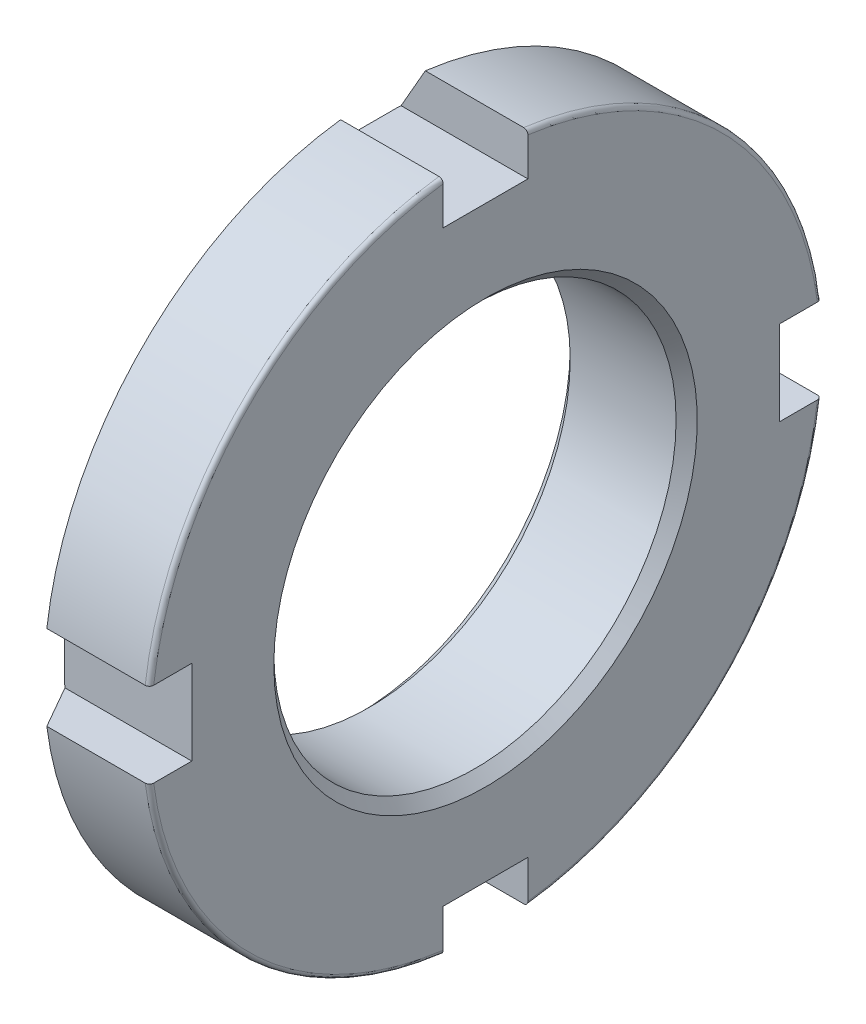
ISO-10303-21;
HEADER;
FILE_DESCRIPTION(('STEP AP214'),'2;1');
FILE_NAME('part.step','',(''),(''),'','','');
FILE_SCHEMA(('AUTOMOTIVE_DESIGN { 1 0 10303 214 1 1 1 1 }'));
ENDSEC;
DATA;
#1=APPLICATION_CONTEXT('core data for automotive mechanical design processes');
#2=APPLICATION_PROTOCOL_DEFINITION('international standard','automotive_design',2000,#1);
#3=PRODUCT_CONTEXT('',#1,'mechanical');
#4=PRODUCT('Part','Part','',(#3));
#5=PRODUCT_RELATED_PRODUCT_CATEGORY('part','',(#4));
#6=PRODUCT_DEFINITION_FORMATION('','',#4);
#7=PRODUCT_DEFINITION_CONTEXT('part definition',#1,'design');
#8=PRODUCT_DEFINITION('design','',#6,#7);
#9=PRODUCT_DEFINITION_SHAPE('','',#8);
#10=(LENGTH_UNIT() NAMED_UNIT(*) SI_UNIT(.MILLI.,.METRE.));
#11=(NAMED_UNIT(*) PLANE_ANGLE_UNIT() SI_UNIT($,.RADIAN.));
#12=(NAMED_UNIT(*) SI_UNIT($,.STERADIAN.) SOLID_ANGLE_UNIT());
#13=UNCERTAINTY_MEASURE_WITH_UNIT(LENGTH_MEASURE(1.E-05),#10,'distance_accuracy_value','');
#14=(GEOMETRIC_REPRESENTATION_CONTEXT(3) GLOBAL_UNCERTAINTY_ASSIGNED_CONTEXT((#13)) GLOBAL_UNIT_ASSIGNED_CONTEXT((#10,
#11,#12)) REPRESENTATION_CONTEXT('',''));
#15=CARTESIAN_POINT('',(0.,0.,0.));
#16=DIRECTION('',(0.,0.,1.));
#17=DIRECTION('',(1.,0.,0.));
#18=AXIS2_PLACEMENT_3D('',#15,#16,#17);
#19=CARTESIAN_POINT('',(5.8,0.,0.));
#20=DIRECTION('',(-1.,0.,0.));
#21=DIRECTION('',(0.,0.,1.));
#22=AXIS2_PLACEMENT_3D('',#19,#20,#21);
#23=TOROIDAL_SURFACE('',#22,15.8,0.199999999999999);
#24=CARTESIAN_POINT('',(6.,0.,0.));
#25=DIRECTION('',(-1.,0.,0.));
#26=DIRECTION('',(0.,0.,1.));
#27=AXIS2_PLACEMENT_3D('',#24,#25,#26);
#28=CIRCLE('',#27,15.8);
#29=CARTESIAN_POINT('',(6.,15.6729065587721,-2.));
#30=VERTEX_POINT('',#29);
#31=CARTESIAN_POINT('',(6.,2.00000000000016,-15.672906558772));
#32=VERTEX_POINT('',#31);
#33=EDGE_CURVE('E539',#30,#32,#28,.T.);
#34=ORIENTED_EDGE('',*,*,#33,.T.);
#35=CARTESIAN_POINT('',(5.87176371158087,2.00000000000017,-15.861083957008));
#36=CARTESIAN_POINT('',(5.86136189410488,2.00000000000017,-15.8651137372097));
#37=CARTESIAN_POINT('',(5.85061313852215,2.00000000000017,-15.8682698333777));
#38=CARTESIAN_POINT('',(5.82872964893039,2.00000000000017,-15.8727349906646));
#39=CARTESIAN_POINT('',(5.81759448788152,2.00000000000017,-15.874041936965));
#40=CARTESIAN_POINT('',(5.79526646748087,2.00000000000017,-15.8747653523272));
#41=CARTESIAN_POINT('',(5.78407363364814,2.00000000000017,-15.8741825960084));
#42=CARTESIAN_POINT('',(5.76194791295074,2.00000000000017,-15.8711453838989));
#43=CARTESIAN_POINT('',(5.75101496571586,2.00000000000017,-15.8686913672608));
#44=CARTESIAN_POINT('',(5.72971790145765,2.00000000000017,-15.861985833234));
#45=CARTESIAN_POINT('',(5.71935365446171,2.00000000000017,-15.857734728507));
#46=CARTESIAN_POINT('',(5.69948150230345,2.00000000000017,-15.8475596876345));
#47=CARTESIAN_POINT('',(5.68997364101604,2.00000000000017,-15.8416356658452));
#48=CARTESIAN_POINT('',(5.6720405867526,2.00000000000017,-15.8282587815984));
#49=CARTESIAN_POINT('',(5.66362006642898,2.00000000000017,-15.8207996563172));
#50=CARTESIAN_POINT('',(5.64813968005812,2.00000000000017,-15.8045827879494));
#51=CARTESIAN_POINT('',(5.64107986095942,2.00000000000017,-15.7958250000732));
#52=CARTESIAN_POINT('',(5.62846605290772,2.00000000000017,-15.7771915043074));
#53=CARTESIAN_POINT('',(5.62292340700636,2.00000000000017,-15.7673081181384));
#54=CARTESIAN_POINT('',(5.61356213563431,2.00000000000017,-15.746756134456));
#55=CARTESIAN_POINT('',(5.60974357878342,2.00000000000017,-15.7360875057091));
#56=CARTESIAN_POINT('',(5.60391107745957,2.00000000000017,-15.7141839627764));
#57=CARTESIAN_POINT('',(5.60191055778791,2.00000000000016,-15.702945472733));
#58=CARTESIAN_POINT('',(5.59981588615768,2.00000000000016,-15.6802921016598));
#59=CARTESIAN_POINT('',(5.59972179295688,2.00000000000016,-15.6688772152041));
#60=CARTESIAN_POINT('',(5.60144606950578,2.00000000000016,-15.6461441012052));
#61=CARTESIAN_POINT('',(5.60327250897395,2.00000000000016,-15.6348264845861));
#62=CARTESIAN_POINT('',(5.60880091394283,2.00000000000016,-15.6126587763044));
#63=CARTESIAN_POINT('',(5.61250288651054,2.00000000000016,-15.6018086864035));
#64=CARTESIAN_POINT('',(5.62167765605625,2.00000000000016,-15.5808952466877));
#65=CARTESIAN_POINT('',(5.62714900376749,2.00000000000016,-15.5708312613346));
#66=CARTESIAN_POINT('',(5.63971271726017,2.00000000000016,-15.5517715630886));
#67=CARTESIAN_POINT('',(5.64680504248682,2.00000000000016,-15.5427758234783));
#68=CARTESIAN_POINT('',(5.66236836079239,2.00000000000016,-15.5261637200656));
#69=CARTESIAN_POINT('',(5.67083137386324,2.00000000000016,-15.5185398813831));
#70=CARTESIAN_POINT('',(5.68892607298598,2.00000000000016,-15.5048350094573));
#71=CARTESIAN_POINT('',(5.69855770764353,2.00000000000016,-15.4987539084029));
#72=CARTESIAN_POINT('',(5.71863369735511,2.00000000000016,-15.4883585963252));
#73=CARTESIAN_POINT('',(5.72907094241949,2.00000000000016,-15.484030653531));
#74=CARTESIAN_POINT('',(5.75052694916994,2.00000000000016,-15.477201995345));
#75=CARTESIAN_POINT('',(5.76154568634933,2.00000000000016,-15.4747012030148));
#76=CARTESIAN_POINT('',(5.78377213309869,2.00000000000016,-15.4716127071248));
#77=CARTESIAN_POINT('',(5.79497806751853,2.00000000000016,-15.4710122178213));
#78=CARTESIAN_POINT('',(5.81733095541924,2.00000000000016,-15.4717061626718));
#79=CARTESIAN_POINT('',(5.82847791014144,2.00000000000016,-15.4730005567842));
#80=CARTESIAN_POINT('',(5.85036856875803,2.00000000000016,-15.4774400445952));
#81=CARTESIAN_POINT('',(5.86111318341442,2.00000000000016,-15.4805806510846));
#82=CARTESIAN_POINT('',(5.88192494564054,2.00000000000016,-15.4886159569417));
#83=CARTESIAN_POINT('',(5.89199208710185,2.00000000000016,-15.4935106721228));
#84=CARTESIAN_POINT('',(5.91119690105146,2.00000000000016,-15.5049279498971));
#85=CARTESIAN_POINT('',(5.92033172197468,2.00000000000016,-15.5114553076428));
#86=CARTESIAN_POINT('',(5.93738551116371,2.00000000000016,-15.5259411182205));
#87=CARTESIAN_POINT('',(5.94530444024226,2.00000000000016,-15.5338996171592));
#88=CARTESIAN_POINT('',(5.95976156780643,2.00000000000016,-15.551080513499));
#89=CARTESIAN_POINT('',(5.96628973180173,2.00000000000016,-15.5603113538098));
#90=CARTESIAN_POINT('',(5.97771794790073,2.00000000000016,-15.5797310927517));
#91=CARTESIAN_POINT('',(5.98261792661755,2.00000000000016,-15.5899200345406));
#92=CARTESIAN_POINT('',(5.99069028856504,2.00000000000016,-15.611052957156));
#93=CARTESIAN_POINT('',(5.99384875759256,2.00000000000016,-15.6220022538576));
#94=CARTESIAN_POINT('',(5.99829355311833,2.00000000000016,-15.6442745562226));
#95=CARTESIAN_POINT('',(5.9995798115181,2.00000000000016,-15.6555975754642));
#96=CARTESIAN_POINT('',(6.00024728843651,2.00000000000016,-15.6783603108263));
#97=CARTESIAN_POINT('',(5.99961831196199,2.00000000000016,-15.689800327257));
#98=CARTESIAN_POINT('',(5.99644981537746,2.00000000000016,-15.7124124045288));
#99=CARTESIAN_POINT('',(5.99391034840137,2.00000000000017,-15.723584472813));
#100=CARTESIAN_POINT('',(5.98698839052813,2.00000000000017,-15.7453468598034));
#101=CARTESIAN_POINT('',(5.98260524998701,2.00000000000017,-15.7559369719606));
#102=CARTESIAN_POINT('',(5.97211402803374,2.00000000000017,-15.7762291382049));
#103=CARTESIAN_POINT('',(5.96600554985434,2.00000000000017,-15.7859309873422));
#104=CARTESIAN_POINT('',(5.95226308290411,2.00000000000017,-15.804123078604));
#105=CARTESIAN_POINT('',(5.94463538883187,2.00000000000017,-15.8126180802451));
#106=CARTESIAN_POINT('',(5.92805776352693,2.00000000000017,-15.8281865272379));
#107=CARTESIAN_POINT('',(5.919109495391,2.00000000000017,-15.8352617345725));
#108=CARTESIAN_POINT('',(5.90369289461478,2.00000000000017,-15.845447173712));
#109=CARTESIAN_POINT('',(5.89754514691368,2.00000000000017,-15.8490517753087));
#110=CARTESIAN_POINT('',(5.88489994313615,2.00000000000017,-15.8555841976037));
#111=CARTESIAN_POINT('',(5.87840248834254,2.00000000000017,-15.8585120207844));
#112=CARTESIAN_POINT('',(5.87176371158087,2.00000000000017,-15.861083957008));
#113=B_SPLINE_CURVE_WITH_KNOTS('',3,(#35,#36,#37,#38,#39,#40,#41,#42,#43,#44,#45,#46,#47,#48,
#49,#50,#51,#52,#53,#54,#55,#56,#57,#58,#59,#60,#61,#62,#63,#64,#65,#66,#67,#68,#69,#70,#71,#72,
#73,#74,#75,#76,#77,#78,#79,#80,#81,#82,#83,#84,#85,#86,#87,#88,#89,#90,#91,#92,#93,#94,#95,#96,
#97,#98,#99,#100,#101,#102,#103,#104,#105,#106,#107,#108,#109,#110,#111,#112),.UNSPECIFIED.,.T.,
.F.,(4,2,2,2,2,2,2,2,2,2,2,2,2,2,2,2,2,2,2,2,2,2,2,2,2,2,2,2,2,2,2,2,2,2,2,2,2,2,4),(0.,
0.0334394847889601,0.0669171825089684,0.100381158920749,0.1338372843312,0.167285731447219,
0.20073589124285,0.234325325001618,0.267915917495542,0.301751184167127,0.335587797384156,
0.369672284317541,0.403757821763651,0.437987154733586,0.472216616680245,0.506418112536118,
0.540618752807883,0.574627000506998,0.608633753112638,0.642368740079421,0.676102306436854,
0.709608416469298,0.743113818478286,0.776538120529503,0.809962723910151,0.84348667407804,
0.877011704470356,0.910770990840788,0.944531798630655,0.978558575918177,1.01258659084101,
1.04679605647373,1.08100457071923,1.11522514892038,1.14945360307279,1.1835430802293,
1.21758998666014,1.23893222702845,1.26027438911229),.UNSPECIFIED.);
#114=CARTESIAN_POINT('',(5.8,2.00000000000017,-15.8745078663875));
#115=VERTEX_POINT('',#114);
#116=EDGE_CURVE('E199',#32,#115,#113,.T.);
#117=ORIENTED_EDGE('',*,*,#116,.T.);
#118=CARTESIAN_POINT('',(5.8,0.,0.));
#119=DIRECTION('',(-1.,0.,0.));
#120=DIRECTION('',(0.,0.,1.));
#121=AXIS2_PLACEMENT_3D('',#118,#119,#120);
#122=CIRCLE('',#121,16.);
#123=CARTESIAN_POINT('',(5.8,15.8745078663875,-2.));
#124=VERTEX_POINT('',#123);
#125=EDGE_CURVE('E536',#124,#115,#122,.T.);
#126=ORIENTED_EDGE('',*,*,#125,.F.);
#127=CARTESIAN_POINT('',(5.86938201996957,15.4837872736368,-2.));
#128=CARTESIAN_POINT('',(5.85893426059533,15.4798912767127,-2.));
#129=CARTESIAN_POINT('',(5.84815081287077,15.4768729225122,-2.));
#130=CARTESIAN_POINT('',(5.82622153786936,15.4726873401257,-2.));
#131=CARTESIAN_POINT('',(5.81507531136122,15.4715222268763,-2.));
#132=CARTESIAN_POINT('',(5.79274921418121,15.4710823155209,-2.));
#133=CARTESIAN_POINT('',(5.78156935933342,15.4718067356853,-2.));
#134=CARTESIAN_POINT('',(5.75949315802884,15.4751228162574,-2.));
#135=CARTESIAN_POINT('',(5.74859674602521,15.4777140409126,-2.));
#136=CARTESIAN_POINT('',(5.72739368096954,15.484685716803,-2.));
#137=CARTESIAN_POINT('',(5.71708696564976,15.4890659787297,-2.));
#138=CARTESIAN_POINT('',(5.69735017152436,15.4994871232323,-2.));
#139=CARTESIAN_POINT('',(5.6879201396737,15.5055280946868,-2.));
#140=CARTESIAN_POINT('',(5.67015647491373,15.5191268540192,-2.));
#141=CARTESIAN_POINT('',(5.66182811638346,15.5266915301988,-2.));
#142=CARTESIAN_POINT('',(5.64654767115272,15.5431021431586,-2.));
#143=CARTESIAN_POINT('',(5.63959563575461,15.5519481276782,-2.));
#144=CARTESIAN_POINT('',(5.62720789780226,15.5707429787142,-2.));
#145=CARTESIAN_POINT('',(5.62178429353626,15.5806998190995,-2.));
#146=CARTESIAN_POINT('',(5.6126716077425,15.6013778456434,-2.));
#147=CARTESIAN_POINT('',(5.60898259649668,15.6120990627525,-2.));
#148=CARTESIAN_POINT('',(5.60341732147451,15.6340861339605,-2.));
#149=CARTESIAN_POINT('',(5.60155457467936,15.6453554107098,-2.));
#150=CARTESIAN_POINT('',(5.59973953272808,15.6680469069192,-2.));
#151=CARTESIAN_POINT('',(5.59978729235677,15.6794691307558,-2.));
#152=CARTESIAN_POINT('',(5.60179611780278,15.7021878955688,-2.));
#153=CARTESIAN_POINT('',(5.60376441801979,15.71348379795,-2.));
#154=CARTESIAN_POINT('',(5.6095720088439,15.7355841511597,-2.));
#155=CARTESIAN_POINT('',(5.61341129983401,15.7463886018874,-2.));
#156=CARTESIAN_POINT('',(5.62284959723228,15.7671815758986,-2.));
#157=CARTESIAN_POINT('',(5.62844614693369,15.7771712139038,-2.));
#158=CARTESIAN_POINT('',(5.64124635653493,15.7960617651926,-2.));
#159=CARTESIAN_POINT('',(5.64844997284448,15.8049627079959,-2.));
#160=CARTESIAN_POINT('',(5.66421577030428,15.8213657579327,-2.));
#161=CARTESIAN_POINT('',(5.6727696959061,15.8288757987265,-2.));
#162=CARTESIAN_POINT('',(5.69102539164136,15.8423397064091,-2.));
#163=CARTESIAN_POINT('',(5.70072711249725,15.8482936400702,-2.));
#164=CARTESIAN_POINT('',(5.72092212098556,15.8584276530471,-2.));
#165=CARTESIAN_POINT('',(5.7314086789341,15.8626211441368,-2.));
#166=CARTESIAN_POINT('',(5.75293964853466,15.8691754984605,-2.));
#167=CARTESIAN_POINT('',(5.76398403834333,15.8715364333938,-2.));
#168=CARTESIAN_POINT('',(5.78624314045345,15.8743459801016,-2.));
#169=CARTESIAN_POINT('',(5.7974563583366,15.8748064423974,-2.));
#170=CARTESIAN_POINT('',(5.81980023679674,15.8738339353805,-2.));
#171=CARTESIAN_POINT('',(5.83093089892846,15.8724010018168,-2.));
#172=CARTESIAN_POINT('',(5.8527700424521,15.8676893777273,-2.));
#173=CARTESIAN_POINT('',(5.863479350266,15.864414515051,-2.));
#174=CARTESIAN_POINT('',(5.88419851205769,15.8561184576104,-2.));
#175=CARTESIAN_POINT('',(5.89420835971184,15.8510972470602,-2.));
#176=CARTESIAN_POINT('',(5.91327763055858,15.8394378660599,-2.));
#177=CARTESIAN_POINT('',(5.92233417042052,15.8327949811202,-2.));
#178=CARTESIAN_POINT('',(5.93921282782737,15.818092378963,-2.));
#179=CARTESIAN_POINT('',(5.94703490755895,15.8100326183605,-2.));
#180=CARTESIAN_POINT('',(5.96127940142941,15.7926680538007,-2.));
#181=CARTESIAN_POINT('',(5.967692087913,15.7833552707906,-2.));
#182=CARTESIAN_POINT('',(5.97887688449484,15.7637918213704,-2.));
#183=CARTESIAN_POINT('',(5.98364892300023,15.7535411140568,-2.));
#184=CARTESIAN_POINT('',(5.99145449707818,15.7323086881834,-2.));
#185=CARTESIAN_POINT('',(5.99447446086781,15.721321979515,-2.));
#186=CARTESIAN_POINT('',(5.99863798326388,15.6989985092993,-2.));
#187=CARTESIAN_POINT('',(5.99978147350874,15.6876617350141,-2.));
#188=CARTESIAN_POINT('',(6.00016258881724,15.6648952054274,-2.));
#189=CARTESIAN_POINT('',(5.99938997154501,15.6534652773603,-2.));
#190=CARTESIAN_POINT('',(5.99593830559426,15.6308972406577,-2.));
#191=CARTESIAN_POINT('',(5.99325930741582,15.6197591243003,-2.));
#192=CARTESIAN_POINT('',(5.98606573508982,15.5980853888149,-2.));
#193=CARTESIAN_POINT('',(5.98155017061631,15.5875500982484,-2.));
#194=CARTESIAN_POINT('',(5.97080534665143,15.5673890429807,-2.));
#195=CARTESIAN_POINT('',(5.96457569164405,15.5577634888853,-2.));
#196=CARTESIAN_POINT('',(5.95060549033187,15.5397423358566,-2.));
#197=CARTESIAN_POINT('',(5.9428710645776,15.5313419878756,-2.));
#198=CARTESIAN_POINT('',(5.92609739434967,15.5159797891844,-2.));
#199=CARTESIAN_POINT('',(5.9170597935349,15.5090161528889,-2.));
#200=CARTESIAN_POINT('',(5.9015136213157,15.4990232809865,-2.));
#201=CARTESIAN_POINT('',(5.89531953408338,15.4954954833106,-2.));
#202=CARTESIAN_POINT('',(5.88258994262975,15.489121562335,-2.));
#203=CARTESIAN_POINT('',(5.8760544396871,15.4862754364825,-2.));
#204=CARTESIAN_POINT('',(5.86938201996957,15.4837872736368,-2.));
#205=B_SPLINE_CURVE_WITH_KNOTS('',3,(#127,#128,#129,#130,#131,#132,#133,#134,#135,#136,#137,
#138,#139,#140,#141,#142,#143,#144,#145,#146,#147,#148,#149,#150,#151,#152,#153,#154,#155,#156,
#157,#158,#159,#160,#161,#162,#163,#164,#165,#166,#167,#168,#169,#170,#171,#172,#173,#174,#175,
#176,#177,#178,#179,#180,#181,#182,#183,#184,#185,#186,#187,#188,#189,#190,#191,#192,#193,#194,
#195,#196,#197,#198,#199,#200,#201,#202,#203,#204),.UNSPECIFIED.,.T.,.F.,(4,2,2,2,2,2,2,2,2,2,2,
2,2,2,2,2,2,2,2,2,2,2,2,2,2,2,2,2,2,2,2,2,2,2,2,2,2,2,4),(0.,0.0334256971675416,
0.0668895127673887,0.1003394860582,0.133781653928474,0.167220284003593,0.200660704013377,
0.234255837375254,0.267852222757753,0.301707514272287,0.335564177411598,0.369669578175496,
0.403775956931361,0.438011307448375,0.472246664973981,0.506434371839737,0.540621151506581,
0.574606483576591,0.608590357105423,0.642310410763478,0.676029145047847,0.709537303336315,
0.743044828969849,0.776482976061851,0.809921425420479,0.84345826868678,0.876996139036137,
0.910758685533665,0.944522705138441,0.978544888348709,1.01256831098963,1.04677399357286,
1.08097877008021,1.11520201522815,1.14943316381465,1.18352788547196,1.21757997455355,
1.2389272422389,1.26027442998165),.UNSPECIFIED.);
#206=EDGE_CURVE('E275',#124,#30,#205,.T.);
#207=ORIENTED_EDGE('',*,*,#206,.T.);
#208=EDGE_LOOP('',(#34,#117,#126,#207));
#209=FACE_BOUND('',#208,.T.);
#210=ADVANCED_FACE('F29',(#209),#23,.T.);
#211=CARTESIAN_POINT('',(0.,0.,0.));
#212=DIRECTION('',(-1.,0.,0.));
#213=DIRECTION('',(0.,0.,1.));
#214=AXIS2_PLACEMENT_3D('',#211,#212,#213);
#215=CYLINDRICAL_SURFACE('',#214,16.);
#216=ORIENTED_EDGE('',*,*,#125,.T.);
#217=DIRECTION('',(-1.,0.,0.));
#218=VECTOR('',#217,1.);
#219=CARTESIAN_POINT('',(0.,2.00000000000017,-15.8745078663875));
#220=LINE('',#219,#218);
#221=CARTESIAN_POINT('',(1.15470053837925,2.00000000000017,-15.8745078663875));
#222=VERTEX_POINT('',#221);
#223=EDGE_CURVE('E264',#115,#222,#220,.T.);
#224=ORIENTED_EDGE('',*,*,#223,.T.);
#225=CARTESIAN_POINT('',(1.15470053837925,0.,0.));
#226=DIRECTION('',(-1.,0.,0.));
#227=DIRECTION('',(0.,0.,1.));
#228=AXIS2_PLACEMENT_3D('',#225,#226,#227);
#229=CIRCLE('',#228,16.);
#230=CARTESIAN_POINT('',(1.15470053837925,15.8745078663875,-2.));
#231=VERTEX_POINT('',#230);
#232=EDGE_CURVE('E347',#231,#222,#229,.T.);
#233=ORIENTED_EDGE('',*,*,#232,.F.);
#234=DIRECTION('',(-1.,0.,0.));
#235=VECTOR('',#234,1.);
#236=CARTESIAN_POINT('',(0.,15.8745078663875,-2.));
#237=LINE('',#236,#235);
#238=EDGE_CURVE('E360',#231,#124,#237,.F.);
#239=ORIENTED_EDGE('',*,*,#238,.T.);
#240=EDGE_LOOP('',(#216,#224,#233,#239));
#241=FACE_BOUND('',#240,.T.);
#242=ADVANCED_FACE('F513',(#241),#215,.T.);
#243=CARTESIAN_POINT('',(1.15470053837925,0.,0.));
#244=DIRECTION('',(1.,0.,0.));
#245=DIRECTION('',(0.,0.,-1.));
#246=AXIS2_PLACEMENT_3D('',#243,#244,#245);
#247=CONICAL_SURFACE('',#246,16.,1.0471975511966);
#248=ORIENTED_EDGE('',*,*,#232,.T.);
#249=CARTESIAN_POINT('',(3.39835405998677,2.00000000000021,-19.7852936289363));
#250=CARTESIAN_POINT('',(3.00206427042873,2.0000000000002,-19.095373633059));
#251=CARTESIAN_POINT('',(2.60590916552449,2.00000000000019,-18.405376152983));
#252=CARTESIAN_POINT('',(1.81404343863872,2.00000000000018,-17.0251271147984));
#253=CARTESIAN_POINT('',(1.4183328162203,2.00000000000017,-16.3348755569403));
#254=CARTESIAN_POINT('',(0.627530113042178,2.00000000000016,-14.954017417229));
#255=CARTESIAN_POINT('',(0.232438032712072,2.00000000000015,-14.2634108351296));
#256=CARTESIAN_POINT('',(-0.35948756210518,2.00000000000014,-13.2270934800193));
#257=CARTESIAN_POINT('',(-0.556677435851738,2.00000000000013,-12.8815862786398));
#258=CARTESIAN_POINT('',(-0.950749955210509,2.00000000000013,-12.1903966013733));
#259=CARTESIAN_POINT('',(-1.14763260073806,2.00000000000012,-11.8447141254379));
#260=CARTESIAN_POINT('',(-1.34432675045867,2.00000000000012,-11.4989243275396));
#261=B_SPLINE_CURVE_WITH_KNOTS('',3,(#249,#250,#251,#252,#253,#254,#255,#256,#257,#258,#259,
#260),.UNSPECIFIED.,.F.,.F.,(4,2,2,2,2,4),(0.,2.38690540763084,4.77380846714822,
7.16071318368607,8.35416671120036,9.54762056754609),.UNSPECIFIED.);
#262=CARTESIAN_POINT('',(0.0103437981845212,2.00000000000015,-13.8745078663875));
#263=VERTEX_POINT('',#262);
#264=EDGE_CURVE('E253',#222,#263,#261,.T.);
#265=ORIENTED_EDGE('',*,*,#264,.T.);
#266=CARTESIAN_POINT('',(0.767736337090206,6.51916576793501,-13.8745078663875));
#267=CARTESIAN_POINT('',(0.686164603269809,6.18695492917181,-13.8745078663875));
#268=CARTESIAN_POINT('',(0.609410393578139,5.85352422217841,-13.8745078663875));
#269=CARTESIAN_POINT('',(0.466603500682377,5.18429008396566,-13.8745078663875));
#270=CARTESIAN_POINT('',(0.400553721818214,4.84848603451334,-13.8745078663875));
#271=CARTESIAN_POINT('',(0.28018920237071,4.17431360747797,-13.8745078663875));
#272=CARTESIAN_POINT('',(0.225889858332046,3.83594245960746,-13.8745078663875));
#273=CARTESIAN_POINT('',(0.130154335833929,3.15740293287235,-13.8745078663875));
#274=CARTESIAN_POINT('',(0.0887171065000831,2.8172347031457,-13.8745078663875));
#275=CARTESIAN_POINT('',(0.0203229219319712,2.14302448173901,-13.8745078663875));
#276=CARTESIAN_POINT('',(-0.00693352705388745,1.80901304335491,-13.8745078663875));
#277=CARTESIAN_POINT('',(-0.0477449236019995,1.14015077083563,-13.8745078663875));
#278=CARTESIAN_POINT('',(-0.0612999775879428,0.805299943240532,-13.8745078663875));
#279=CARTESIAN_POINT('',(-0.0743984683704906,0.135613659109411,-13.8745078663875));
#280=CARTESIAN_POINT('',(-0.0739540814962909,-0.199221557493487,-13.8745078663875));
#281=CARTESIAN_POINT('',(-0.0590938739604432,-0.868610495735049,-13.8745078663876));
#282=CARTESIAN_POINT('',(-0.0446767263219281,-1.20316418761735,-13.8745078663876));
#283=CARTESIAN_POINT('',(-0.00228331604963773,-1.86992250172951,-13.8745078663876));
#284=CARTESIAN_POINT('',(0.0256326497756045,-2.20213096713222,-13.8745078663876));
#285=CARTESIAN_POINT('',(0.0944011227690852,-2.86521620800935,-13.8745078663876));
#286=CARTESIAN_POINT('',(0.135254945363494,-3.19609284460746,-13.8745078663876));
#287=CARTESIAN_POINT('',(0.276081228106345,-4.18625229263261,-13.8745078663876));
#288=CARTESIAN_POINT('',(0.394314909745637,-4.8430116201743,-13.8745078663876));
#289=CARTESIAN_POINT('',(0.603931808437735,-5.82907076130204,-13.8745078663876));
#290=CARTESIAN_POINT('',(0.680251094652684,-6.16173099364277,-13.8745078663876));
#291=CARTESIAN_POINT('',(0.842480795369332,-6.82462365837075,-13.8745078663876));
#292=CARTESIAN_POINT('',(0.928388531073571,-7.15485674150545,-13.8745078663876));
#293=CARTESIAN_POINT('',(1.10855110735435,-7.81217837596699,-13.8745078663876));
#294=CARTESIAN_POINT('',(1.20278568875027,-8.13927252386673,-13.8745078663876));
#295=CARTESIAN_POINT('',(1.39883939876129,-8.79122385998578,-13.8745078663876));
#296=CARTESIAN_POINT('',(1.50065938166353,-9.11608079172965,-13.8745078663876));
#297=CARTESIAN_POINT('',(1.60579341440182,-9.43984061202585,-13.8745078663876));
#298=B_SPLINE_CURVE_WITH_KNOTS('',3,(#266,#267,#268,#269,#270,#271,#272,#273,#274,#275,#276,
#277,#278,#279,#280,#281,#282,#283,#284,#285,#286,#287,#288,#289,#290,#291,#292,#293,#294,#295,
#296,#297),.UNSPECIFIED.,.F.,.F.,(4,2,2,2,2,2,2,2,2,2,2,2,2,2,2,4),(0.,1.02625425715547,
2.05278649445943,3.08065575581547,4.10844101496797,5.11353512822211,6.1186214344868,
7.1228335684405,8.12714108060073,9.12700339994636,10.126967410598,12.127054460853,
13.1508660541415,14.1743923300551,15.195493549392,16.2167099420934),.UNSPECIFIED.);
#299=CARTESIAN_POINT('',(0.,1.87030250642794,-13.8745078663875));
#300=VERTEX_POINT('',#299);
#301=EDGE_CURVE('E212',#263,#300,#298,.T.);
#302=ORIENTED_EDGE('',*,*,#301,.T.);
#303=CARTESIAN_POINT('',(0.,0.,0.));
#304=DIRECTION('',(-1.,0.,0.));
#305=DIRECTION('',(0.,0.,1.));
#306=AXIS2_PLACEMENT_3D('',#303,#304,#305);
#307=CIRCLE('',#306,14.);
#308=CARTESIAN_POINT('',(0.,13.8745078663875,-1.87030250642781));
#309=VERTEX_POINT('',#308);
#310=EDGE_CURVE('E335',#309,#300,#307,.T.);
#311=ORIENTED_EDGE('',*,*,#310,.F.);
#312=CARTESIAN_POINT('',(0.767736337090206,13.8745078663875,6.51916576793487));
#313=CARTESIAN_POINT('',(0.686164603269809,13.8745078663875,6.18695492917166));
#314=CARTESIAN_POINT('',(0.60941039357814,13.8745078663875,5.85352422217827));
#315=CARTESIAN_POINT('',(0.466603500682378,13.8745078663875,5.18429008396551));
#316=CARTESIAN_POINT('',(0.400553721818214,13.8745078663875,4.8484860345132));
#317=CARTESIAN_POINT('',(0.28018920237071,13.8745078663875,4.17431360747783));
#318=CARTESIAN_POINT('',(0.225889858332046,13.8745078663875,3.83594245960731));
#319=CARTESIAN_POINT('',(0.130154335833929,13.8745078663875,3.15740293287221));
#320=CARTESIAN_POINT('',(0.088717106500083,13.8745078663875,2.81723470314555));
#321=CARTESIAN_POINT('',(0.0203229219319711,13.8745078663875,2.14302448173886));
#322=CARTESIAN_POINT('',(-0.00693352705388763,13.8745078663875,1.80901304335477));
#323=CARTESIAN_POINT('',(-0.047744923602,13.8745078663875,1.14015077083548));
#324=CARTESIAN_POINT('',(-0.0612999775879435,13.8745078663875,0.805299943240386));
#325=CARTESIAN_POINT('',(-0.0743984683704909,13.8745078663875,0.135613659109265));
#326=CARTESIAN_POINT('',(-0.0739540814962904,13.8745078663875,-0.199221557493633));
#327=CARTESIAN_POINT('',(-0.0590938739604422,13.8745078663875,-0.868610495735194));
#328=CARTESIAN_POINT('',(-0.0446767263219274,13.8745078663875,-1.20316418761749));
#329=CARTESIAN_POINT('',(-0.00228331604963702,13.8745078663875,-1.86992250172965));
#330=CARTESIAN_POINT('',(0.0256326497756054,13.8745078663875,-2.20213096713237));
#331=CARTESIAN_POINT('',(0.0944011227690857,13.8745078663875,-2.86521620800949));
#332=CARTESIAN_POINT('',(0.135254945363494,13.8745078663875,-3.19609284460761));
#333=CARTESIAN_POINT('',(0.276081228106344,13.8745078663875,-4.18625229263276));
#334=CARTESIAN_POINT('',(0.394314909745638,13.8745078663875,-4.84301162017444));
#335=CARTESIAN_POINT('',(0.603931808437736,13.8745078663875,-5.82907076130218));
#336=CARTESIAN_POINT('',(0.680251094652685,13.8745078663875,-6.16173099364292));
#337=CARTESIAN_POINT('',(0.842480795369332,13.8745078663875,-6.82462365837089));
#338=CARTESIAN_POINT('',(0.928388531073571,13.8745078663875,-7.15485674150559));
#339=CARTESIAN_POINT('',(1.10855110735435,13.8745078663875,-7.81217837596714));
#340=CARTESIAN_POINT('',(1.20278568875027,13.8745078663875,-8.13927252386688));
#341=CARTESIAN_POINT('',(1.39883939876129,13.8745078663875,-8.79122385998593));
#342=CARTESIAN_POINT('',(1.50065938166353,13.8745078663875,-9.1160807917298));
#343=CARTESIAN_POINT('',(1.60579341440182,13.8745078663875,-9.439840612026));
#344=B_SPLINE_CURVE_WITH_KNOTS('',3,(#312,#313,#314,#315,#316,#317,#318,#319,#320,#321,#322,
#323,#324,#325,#326,#327,#328,#329,#330,#331,#332,#333,#334,#335,#336,#337,#338,#339,#340,#341,
#342,#343),.UNSPECIFIED.,.F.,.F.,(4,2,2,2,2,2,2,2,2,2,2,2,2,2,2,4),(0.,1.02625425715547,
2.05278649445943,3.08065575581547,4.10844101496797,5.11353512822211,6.1186214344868,
7.12283356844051,8.12714108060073,9.12700339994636,10.126967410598,12.127054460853,
13.1508660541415,14.1743923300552,15.195493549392,16.2167099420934),.UNSPECIFIED.);
#345=CARTESIAN_POINT('',(0.0103437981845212,13.8745078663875,-2.));
#346=VERTEX_POINT('',#345);
#347=EDGE_CURVE('E369',#309,#346,#344,.T.);
#348=ORIENTED_EDGE('',*,*,#347,.T.);
#349=CARTESIAN_POINT('',(-2.16885870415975,10.046282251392,-2.));
#350=CARTESIAN_POINT('',(-1.97283397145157,10.3924528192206,-2.));
#351=CARTESIAN_POINT('',(-1.77653221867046,10.7384662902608,-2.));
#352=CARTESIAN_POINT('',(-1.38348662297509,11.4302418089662,-2.));
#353=CARTESIAN_POINT('',(-1.18674278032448,11.7760038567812,-2.));
#354=CARTESIAN_POINT('',(-0.596016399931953,12.813006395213,-2.));
#355=CARTESIAN_POINT('',(-0.201538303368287,13.5039645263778,-2.));
#356=CARTESIAN_POINT('',(0.588238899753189,14.8854098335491,-2.));
#357=CARTESIAN_POINT('',(0.983538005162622,15.5758970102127,-2.));
#358=CARTESIAN_POINT('',(1.77471066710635,16.9565438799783,-2.));
#359=CARTESIAN_POINT('',(2.17058422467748,17.6467035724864,-2.));
#360=CARTESIAN_POINT('',(2.56662073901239,18.3367695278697,-2.));
#361=B_SPLINE_CURVE_WITH_KNOTS('',3,(#349,#350,#351,#352,#353,#354,#355,#356,#357,#358,#359,
#360),.UNSPECIFIED.,.F.,.F.,(4,2,2,2,2,4),(0.,1.1934558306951,2.38691094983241,4.77381689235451,
7.16071949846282,9.54762641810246),.UNSPECIFIED.);
#362=EDGE_CURVE('E402',#346,#231,#361,.T.);
#363=ORIENTED_EDGE('',*,*,#362,.T.);
#364=EDGE_LOOP('',(#248,#265,#302,#311,#348,#363));
#365=FACE_BOUND('',#364,.T.);
#366=ADVANCED_FACE('F333',(#365),#247,.T.);
#367=CARTESIAN_POINT('',(5.8,-1.99999999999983,-15.8745078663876));
#368=VERTEX_POINT('',#367);
#369=CARTESIAN_POINT('',(5.8,-15.8745078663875,-2.00000000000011));
#370=VERTEX_POINT('',#369);
#371=EDGE_CURVE('E533',#368,#370,#122,.T.);
#372=ORIENTED_EDGE('',*,*,#371,.F.);
#373=CARTESIAN_POINT('',(5.87176371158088,-1.99999999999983,-15.861083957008));
#374=CARTESIAN_POINT('',(5.88224262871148,-1.99999999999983,-15.8570232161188));
#375=CARTESIAN_POINT('',(5.8923847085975,-1.99999999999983,-15.852069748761));
#376=CARTESIAN_POINT('',(5.91169927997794,-1.99999999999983,-15.8405226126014));
#377=CARTESIAN_POINT('',(5.9208705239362,-1.99999999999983,-15.8339268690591));
#378=CARTESIAN_POINT('',(5.93797084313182,-1.99999999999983,-15.8192961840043));
#379=CARTESIAN_POINT('',(5.94590089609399,-1.99999999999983,-15.811262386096));
#380=CARTESIAN_POINT('',(5.9603063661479,-1.99999999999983,-15.7939863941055));
#381=CARTESIAN_POINT('',(5.96678213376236,-1.99999999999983,-15.7847444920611));
#382=CARTESIAN_POINT('',(5.97813902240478,-1.99999999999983,-15.7652577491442));
#383=CARTESIAN_POINT('',(5.98301091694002,-1.99999999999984,-15.7550075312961));
#384=CARTESIAN_POINT('',(5.9909784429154,-1.99999999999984,-15.7338380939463));
#385=CARTESIAN_POINT('',(5.9940739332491,-1.99999999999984,-15.7229188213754));
#386=CARTESIAN_POINT('',(5.99842083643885,-1.99999999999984,-15.7006405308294));
#387=CARTESIAN_POINT('',(5.99965933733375,-1.99999999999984,-15.6892789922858));
#388=CARTESIAN_POINT('',(6.00021827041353,-1.99999999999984,-15.6665087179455));
#389=CARTESIAN_POINT('',(5.99953865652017,-1.99999999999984,-15.6550999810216));
#390=CARTESIAN_POINT('',(5.99627427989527,-1.99999999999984,-15.6325196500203));
#391=CARTESIAN_POINT('',(5.99368323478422,-1.99999999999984,-15.6213489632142));
#392=CARTESIAN_POINT('',(5.98665913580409,-1.99999999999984,-15.5996023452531));
#393=CARTESIAN_POINT('',(5.98222608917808,-1.99999999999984,-15.5890264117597));
#394=CARTESIAN_POINT('',(5.9716494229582,-1.99999999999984,-15.5687926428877));
#395=CARTESIAN_POINT('',(5.9655090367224,-1.99999999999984,-15.5591331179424));
#396=CARTESIAN_POINT('',(5.95168399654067,-1.99999999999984,-15.5409905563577));
#397=CARTESIAN_POINT('',(5.94399938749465,-1.99999999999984,-15.5325074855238));
#398=CARTESIAN_POINT('',(5.92735511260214,-1.99999999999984,-15.5170176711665));
#399=CARTESIAN_POINT('',(5.91840386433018,-1.99999999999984,-15.5100018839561));
#400=CARTESIAN_POINT('',(5.89944264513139,-1.99999999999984,-15.4975871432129));
#401=CARTESIAN_POINT('',(5.88943272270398,-1.99999999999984,-15.4921881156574));
#402=CARTESIAN_POINT('',(5.86872477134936,-1.99999999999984,-15.4832054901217));
#403=CARTESIAN_POINT('',(5.85803292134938,-1.99999999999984,-15.4796076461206));
#404=CARTESIAN_POINT('',(5.83619506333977,-1.99999999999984,-15.4742704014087));
#405=CARTESIAN_POINT('',(5.82504907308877,-1.99999999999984,-15.4725309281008));
#406=CARTESIAN_POINT('',(5.80269179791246,-1.99999999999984,-15.4709675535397));
#407=CARTESIAN_POINT('',(5.79148132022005,-1.99999999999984,-15.471132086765));
#408=CARTESIAN_POINT('',(5.76924781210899,-1.99999999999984,-15.4733437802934));
#409=CARTESIAN_POINT('',(5.75822477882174,-1.99999999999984,-15.4753909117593));
#410=CARTESIAN_POINT('',(5.73669359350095,-1.99999999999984,-15.4813027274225));
#411=CARTESIAN_POINT('',(5.72618477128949,-1.99999999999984,-15.4851649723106));
#412=CARTESIAN_POINT('',(5.705961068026,-1.99999999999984,-15.4945921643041));
#413=CARTESIAN_POINT('',(5.69624619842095,-1.99999999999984,-15.5001571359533));
#414=CARTESIAN_POINT('',(5.67784326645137,-1.99999999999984,-15.5128529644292));
#415=CARTESIAN_POINT('',(5.66915942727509,-1.99999999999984,-15.5199899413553));
#416=CARTESIAN_POINT('',(5.65310215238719,-1.99999999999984,-15.535610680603));
#417=CARTESIAN_POINT('',(5.64572876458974,-1.99999999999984,-15.5440944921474));
#418=CARTESIAN_POINT('',(5.63244262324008,-1.99999999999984,-15.5622352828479));
#419=CARTESIAN_POINT('',(5.6265411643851,-1.99999999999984,-15.5719005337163));
#420=CARTESIAN_POINT('',(5.61643037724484,-1.99999999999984,-15.5920788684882));
#421=CARTESIAN_POINT('',(5.61222112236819,-1.99999999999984,-15.602591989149));
#422=CARTESIAN_POINT('',(5.60558207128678,-1.99999999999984,-15.6242537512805));
#423=CARTESIAN_POINT('',(5.60316608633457,-1.99999999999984,-15.6354066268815));
#424=CARTESIAN_POINT('',(5.60023153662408,-1.99999999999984,-15.6579593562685));
#425=CARTESIAN_POINT('',(5.59971302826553,-1.99999999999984,-15.6693592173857));
#426=CARTESIAN_POINT('',(5.60058958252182,-1.99999999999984,-15.6921363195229));
#427=CARTESIAN_POINT('',(5.60199318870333,-1.99999999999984,-15.7035132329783));
#428=CARTESIAN_POINT('',(5.60669150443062,-1.99999999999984,-15.7258698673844));
#429=CARTESIAN_POINT('',(5.60998622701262,-1.99999999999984,-15.7368495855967));
#430=CARTESIAN_POINT('',(5.61837472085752,-1.99999999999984,-15.7580913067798));
#431=CARTESIAN_POINT('',(5.62346738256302,-1.99999999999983,-15.7683537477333));
#432=CARTESIAN_POINT('',(5.63531223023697,-1.99999999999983,-15.7878717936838));
#433=CARTESIAN_POINT('',(5.64206437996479,-1.99999999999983,-15.7971274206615));
#434=CARTESIAN_POINT('',(5.65699965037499,-1.99999999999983,-15.8143146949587));
#435=CARTESIAN_POINT('',(5.66517494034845,-1.99999999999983,-15.8222531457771));
#436=CARTESIAN_POINT('',(5.68275096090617,-1.99999999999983,-15.8366316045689));
#437=CARTESIAN_POINT('',(5.69215159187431,-1.99999999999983,-15.8430717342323));
#438=CARTESIAN_POINT('',(5.71183296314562,-1.99999999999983,-15.8542179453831));
#439=CARTESIAN_POINT('',(5.7221062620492,-1.99999999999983,-15.8589371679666));
#440=CARTESIAN_POINT('',(5.7433057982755,-1.99999999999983,-15.8665717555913));
#441=CARTESIAN_POINT('',(5.75423217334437,-1.99999999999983,-15.8694867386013));
#442=CARTESIAN_POINT('',(5.77635087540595,-1.99999999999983,-15.87341157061));
#443=CARTESIAN_POINT('',(5.78754113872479,-1.99999999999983,-15.8744330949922));
#444=CARTESIAN_POINT('',(5.80992417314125,-1.99999999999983,-15.8745745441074));
#445=CARTESIAN_POINT('',(5.82111692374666,-1.99999999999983,-15.8736968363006));
#446=CARTESIAN_POINT('',(5.83891556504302,-1.99999999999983,-15.8707761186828));
#447=CARTESIAN_POINT('',(5.84562224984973,-1.99999999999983,-15.8693146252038));
#448=CARTESIAN_POINT('',(5.85884900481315,-1.99999999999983,-15.8657075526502));
#449=CARTESIAN_POINT('',(5.86536907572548,-1.99999999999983,-15.8635619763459));
#450=CARTESIAN_POINT('',(5.87176371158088,-1.99999999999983,-15.861083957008));
#451=B_SPLINE_CURVE_WITH_KNOTS('',3,(#373,#374,#375,#376,#377,#378,#379,#380,#381,#382,#383,
#384,#385,#386,#387,#388,#389,#390,#391,#392,#393,#394,#395,#396,#397,#398,#399,#400,#401,#402,
#403,#404,#405,#406,#407,#408,#409,#410,#411,#412,#413,#414,#415,#416,#417,#418,#419,#420,#421,
#422,#423,#424,#425,#426,#427,#428,#429,#430,#431,#432,#433,#434,#435,#436,#437,#438,#439,#440,
#441,#442,#443,#444,#445,#446,#447,#448,#449,#450),.UNSPECIFIED.,.T.,.F.,(4,2,2,2,2,2,2,2,2,2,2,
2,2,2,2,2,2,2,2,2,2,2,2,2,2,2,2,2,2,2,2,2,2,2,2,2,2,2,4),(0.,0.0336893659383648,
0.0674215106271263,0.101126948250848,0.134824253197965,0.168712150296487,0.202602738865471,
0.236727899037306,0.2708538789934,0.305092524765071,0.339331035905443,0.373505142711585,
0.407678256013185,0.441634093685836,0.475588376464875,0.509269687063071,0.542949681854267,
0.576425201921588,0.609900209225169,0.643330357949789,0.676760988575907,0.710324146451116,
0.74388853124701,0.777703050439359,0.811519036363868,0.845592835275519,0.879667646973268,
0.913894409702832,0.948121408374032,0.982327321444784,1.01653248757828,1.0505550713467,
1.0845748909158,1.11832920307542,1.152090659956,1.18564323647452,1.21915401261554,
1.23971263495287,1.2602711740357),.UNSPECIFIED.);
#452=CARTESIAN_POINT('',(6.,-1.99999999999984,-15.6729065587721));
#453=VERTEX_POINT('',#452);
#454=EDGE_CURVE('E318',#368,#453,#451,.T.);
#455=ORIENTED_EDGE('',*,*,#454,.T.);
#456=CARTESIAN_POINT('',(6.,-15.672906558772,-2.00000000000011));
#457=VERTEX_POINT('',#456);
#458=EDGE_CURVE('E540',#453,#457,#28,.T.);
#459=ORIENTED_EDGE('',*,*,#458,.T.);
#460=CARTESIAN_POINT('',(5.87176371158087,-15.861083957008,-2.00000000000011));
#461=CARTESIAN_POINT('',(5.86136189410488,-15.8651137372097,-2.00000000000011));
#462=CARTESIAN_POINT('',(5.85061313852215,-15.8682698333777,-2.00000000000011));
#463=CARTESIAN_POINT('',(5.82872964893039,-15.8727349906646,-2.00000000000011));
#464=CARTESIAN_POINT('',(5.81759448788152,-15.874041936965,-2.00000000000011));
#465=CARTESIAN_POINT('',(5.79526646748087,-15.8747653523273,-2.00000000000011));
#466=CARTESIAN_POINT('',(5.78407363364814,-15.8741825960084,-2.00000000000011));
#467=CARTESIAN_POINT('',(5.76194791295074,-15.8711453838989,-2.00000000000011));
#468=CARTESIAN_POINT('',(5.75101496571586,-15.8686913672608,-2.00000000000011));
#469=CARTESIAN_POINT('',(5.72971790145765,-15.861985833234,-2.00000000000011));
#470=CARTESIAN_POINT('',(5.71935365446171,-15.857734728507,-2.00000000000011));
#471=CARTESIAN_POINT('',(5.69948150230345,-15.8475596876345,-2.00000000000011));
#472=CARTESIAN_POINT('',(5.68997364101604,-15.8416356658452,-2.00000000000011));
#473=CARTESIAN_POINT('',(5.6720405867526,-15.8282587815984,-2.00000000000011));
#474=CARTESIAN_POINT('',(5.66362006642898,-15.8207996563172,-2.00000000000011));
#475=CARTESIAN_POINT('',(5.64813968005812,-15.8045827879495,-2.00000000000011));
#476=CARTESIAN_POINT('',(5.64107986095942,-15.7958250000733,-2.00000000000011));
#477=CARTESIAN_POINT('',(5.62846605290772,-15.7771915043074,-2.00000000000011));
#478=CARTESIAN_POINT('',(5.62292340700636,-15.7673081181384,-2.00000000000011));
#479=CARTESIAN_POINT('',(5.61356213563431,-15.746756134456,-2.00000000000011));
#480=CARTESIAN_POINT('',(5.60974357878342,-15.7360875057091,-2.00000000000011));
#481=CARTESIAN_POINT('',(5.60391107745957,-15.7141839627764,-2.00000000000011));
#482=CARTESIAN_POINT('',(5.60191055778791,-15.702945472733,-2.00000000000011));
#483=CARTESIAN_POINT('',(5.59981588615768,-15.6802921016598,-2.00000000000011));
#484=CARTESIAN_POINT('',(5.59972179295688,-15.6688772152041,-2.00000000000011));
#485=CARTESIAN_POINT('',(5.60144606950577,-15.6461441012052,-2.00000000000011));
#486=CARTESIAN_POINT('',(5.60327250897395,-15.6348264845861,-2.00000000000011));
#487=CARTESIAN_POINT('',(5.60880091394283,-15.6126587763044,-2.00000000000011));
#488=CARTESIAN_POINT('',(5.61250288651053,-15.6018086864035,-2.00000000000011));
#489=CARTESIAN_POINT('',(5.62167765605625,-15.5808952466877,-2.00000000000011));
#490=CARTESIAN_POINT('',(5.62714900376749,-15.5708312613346,-2.00000000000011));
#491=CARTESIAN_POINT('',(5.63971271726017,-15.5517715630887,-2.00000000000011));
#492=CARTESIAN_POINT('',(5.64680504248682,-15.5427758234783,-2.00000000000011));
#493=CARTESIAN_POINT('',(5.66236836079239,-15.5261637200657,-2.00000000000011));
#494=CARTESIAN_POINT('',(5.67083137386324,-15.5185398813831,-2.00000000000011));
#495=CARTESIAN_POINT('',(5.68892607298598,-15.5048350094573,-2.00000000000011));
#496=CARTESIAN_POINT('',(5.69855770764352,-15.4987539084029,-2.00000000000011));
#497=CARTESIAN_POINT('',(5.71863369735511,-15.4883585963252,-2.00000000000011));
#498=CARTESIAN_POINT('',(5.72907094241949,-15.484030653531,-2.00000000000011));
#499=CARTESIAN_POINT('',(5.75052694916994,-15.477201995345,-2.00000000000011));
#500=CARTESIAN_POINT('',(5.76154568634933,-15.4747012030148,-2.00000000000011));
#501=CARTESIAN_POINT('',(5.78377213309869,-15.4716127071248,-2.00000000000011));
#502=CARTESIAN_POINT('',(5.79497806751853,-15.4710122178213,-2.00000000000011));
#503=CARTESIAN_POINT('',(5.81733095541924,-15.4717061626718,-2.00000000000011));
#504=CARTESIAN_POINT('',(5.82847791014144,-15.4730005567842,-2.00000000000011));
#505=CARTESIAN_POINT('',(5.85036856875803,-15.4774400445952,-2.00000000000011));
#506=CARTESIAN_POINT('',(5.86111318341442,-15.4805806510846,-2.00000000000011));
#507=CARTESIAN_POINT('',(5.88192494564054,-15.4886159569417,-2.00000000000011));
#508=CARTESIAN_POINT('',(5.89199208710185,-15.4935106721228,-2.00000000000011));
#509=CARTESIAN_POINT('',(5.91119690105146,-15.5049279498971,-2.00000000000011));
#510=CARTESIAN_POINT('',(5.92033172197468,-15.5114553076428,-2.00000000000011));
#511=CARTESIAN_POINT('',(5.93738551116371,-15.5259411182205,-2.00000000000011));
#512=CARTESIAN_POINT('',(5.94530444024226,-15.5338996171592,-2.00000000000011));
#513=CARTESIAN_POINT('',(5.95976156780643,-15.551080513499,-2.00000000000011));
#514=CARTESIAN_POINT('',(5.96628973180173,-15.5603113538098,-2.00000000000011));
#515=CARTESIAN_POINT('',(5.97771794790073,-15.5797310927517,-2.00000000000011));
#516=CARTESIAN_POINT('',(5.98261792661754,-15.5899200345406,-2.00000000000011));
#517=CARTESIAN_POINT('',(5.99069028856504,-15.611052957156,-2.00000000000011));
#518=CARTESIAN_POINT('',(5.99384875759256,-15.6220022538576,-2.00000000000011));
#519=CARTESIAN_POINT('',(5.99829355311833,-15.6442745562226,-2.00000000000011));
#520=CARTESIAN_POINT('',(5.9995798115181,-15.6555975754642,-2.00000000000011));
#521=CARTESIAN_POINT('',(6.00024728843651,-15.6783603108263,-2.00000000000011));
#522=CARTESIAN_POINT('',(5.99961831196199,-15.689800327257,-2.00000000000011));
#523=CARTESIAN_POINT('',(5.99644981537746,-15.7124124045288,-2.00000000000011));
#524=CARTESIAN_POINT('',(5.99391034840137,-15.7235844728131,-2.00000000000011));
#525=CARTESIAN_POINT('',(5.98698839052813,-15.7453468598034,-2.00000000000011));
#526=CARTESIAN_POINT('',(5.98260524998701,-15.7559369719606,-2.00000000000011));
#527=CARTESIAN_POINT('',(5.97211402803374,-15.7762291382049,-2.00000000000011));
#528=CARTESIAN_POINT('',(5.96600554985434,-15.7859309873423,-2.00000000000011));
#529=CARTESIAN_POINT('',(5.95226308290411,-15.804123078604,-2.00000000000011));
#530=CARTESIAN_POINT('',(5.94463538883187,-15.8126180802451,-2.00000000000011));
#531=CARTESIAN_POINT('',(5.92805776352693,-15.8281865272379,-2.00000000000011));
#532=CARTESIAN_POINT('',(5.919109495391,-15.8352617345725,-2.00000000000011));
#533=CARTESIAN_POINT('',(5.90369289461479,-15.845447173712,-2.00000000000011));
#534=CARTESIAN_POINT('',(5.89754514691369,-15.8490517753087,-2.00000000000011));
#535=CARTESIAN_POINT('',(5.88489994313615,-15.8555841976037,-2.00000000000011));
#536=CARTESIAN_POINT('',(5.87840248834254,-15.8585120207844,-2.00000000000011));
#537=CARTESIAN_POINT('',(5.87176371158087,-15.861083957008,-2.00000000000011));
#538=B_SPLINE_CURVE_WITH_KNOTS('',3,(#460,#461,#462,#463,#464,#465,#466,#467,#468,#469,#470,
#471,#472,#473,#474,#475,#476,#477,#478,#479,#480,#481,#482,#483,#484,#485,#486,#487,#488,#489,
#490,#491,#492,#493,#494,#495,#496,#497,#498,#499,#500,#501,#502,#503,#504,#505,#506,#507,#508,
#509,#510,#511,#512,#513,#514,#515,#516,#517,#518,#519,#520,#521,#522,#523,#524,#525,#526,#527,
#528,#529,#530,#531,#532,#533,#534,#535,#536,#537),.UNSPECIFIED.,.T.,.F.,(4,2,2,2,2,2,2,2,2,2,2,
2,2,2,2,2,2,2,2,2,2,2,2,2,2,2,2,2,2,2,2,2,2,2,2,2,2,2,4),(0.,0.0334394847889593,
0.0669171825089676,0.100381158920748,0.133837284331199,0.167285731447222,0.200735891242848,
0.234325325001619,0.267915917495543,0.301751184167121,0.335587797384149,0.369672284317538,
0.403757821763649,0.437987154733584,0.472216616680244,0.506418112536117,0.540618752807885,
0.574627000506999,0.608633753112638,0.642368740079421,0.676102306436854,0.709608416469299,
0.743113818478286,0.776538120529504,0.809962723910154,0.843486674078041,0.877011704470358,
0.910770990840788,0.944531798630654,0.978558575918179,1.01258659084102,1.04679605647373,
1.08100457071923,1.11522514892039,1.1494536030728,1.1835430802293,1.21758998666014,
1.23893222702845,1.26027438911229),.UNSPECIFIED.);
#539=EDGE_CURVE('E312',#457,#370,#538,.T.);
#540=ORIENTED_EDGE('',*,*,#539,.T.);
#541=EDGE_LOOP('',(#372,#455,#459,#540));
#542=FACE_BOUND('',#541,.T.);
#543=ADVANCED_FACE('F514',(#542),#23,.T.);
#544=CARTESIAN_POINT('',(1.15470053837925,-1.99999999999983,-15.8745078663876));
#545=VERTEX_POINT('',#544);
#546=CARTESIAN_POINT('',(1.15470053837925,-15.8745078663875,-2.00000000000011));
#547=VERTEX_POINT('',#546);
#548=EDGE_CURVE('E545',#545,#547,#229,.T.);
#549=ORIENTED_EDGE('',*,*,#548,.F.);
#550=DIRECTION('',(-1.,0.,0.));
#551=VECTOR('',#550,1.);
#552=CARTESIAN_POINT('',(0.,-1.99999999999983,-15.8745078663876));
#553=LINE('',#552,#551);
#554=EDGE_CURVE('E322',#545,#368,#553,.F.);
#555=ORIENTED_EDGE('',*,*,#554,.T.);
#556=ORIENTED_EDGE('',*,*,#371,.T.);
#557=DIRECTION('',(-1.,0.,0.));
#558=VECTOR('',#557,1.);
#559=CARTESIAN_POINT('',(0.,-15.8745078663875,-2.00000000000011));
#560=LINE('',#559,#558);
#561=EDGE_CURVE('E470',#370,#547,#560,.T.);
#562=ORIENTED_EDGE('',*,*,#561,.T.);
#563=EDGE_LOOP('',(#549,#555,#556,#562));
#564=FACE_BOUND('',#563,.T.);
#565=ADVANCED_FACE('F518',(#564),#215,.T.);
#566=CARTESIAN_POINT('',(0.,-1.87030250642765,-13.8745078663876));
#567=VERTEX_POINT('',#566);
#568=CARTESIAN_POINT('',(0.0103437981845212,-1.99999999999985,-13.8745078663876));
#569=VERTEX_POINT('',#568);
#570=EDGE_CURVE('E44',#567,#569,#298,.T.);
#571=ORIENTED_EDGE('',*,*,#570,.T.);
#572=CARTESIAN_POINT('',(-1.34432675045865,-1.99999999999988,-11.4989243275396));
#573=CARTESIAN_POINT('',(-1.14763260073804,-1.99999999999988,-11.844714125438));
#574=CARTESIAN_POINT('',(-0.950749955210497,-1.99999999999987,-12.1903966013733));
#575=CARTESIAN_POINT('',(-0.556677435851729,-1.99999999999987,-12.8815862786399));
#576=CARTESIAN_POINT('',(-0.359487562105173,-1.99999999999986,-13.2270934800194));
#577=CARTESIAN_POINT('',(0.232438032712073,-1.99999999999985,-14.2634108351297));
#578=CARTESIAN_POINT('',(0.627530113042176,-1.99999999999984,-14.9540174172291));
#579=CARTESIAN_POINT('',(1.41833281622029,-1.99999999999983,-16.3348755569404));
#580=CARTESIAN_POINT('',(1.81404343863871,-1.99999999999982,-17.0251271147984));
#581=CARTESIAN_POINT('',(2.60590916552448,-1.99999999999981,-18.405376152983));
#582=CARTESIAN_POINT('',(3.0020642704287,-1.9999999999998,-19.095373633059));
#583=CARTESIAN_POINT('',(3.39835405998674,-1.99999999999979,-19.7852936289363));
#584=B_SPLINE_CURVE_WITH_KNOTS('',3,(#572,#573,#574,#575,#576,#577,#578,#579,#580,#581,#582,
#583),.UNSPECIFIED.,.F.,.F.,(4,2,2,2,2,4),(0.,1.19345385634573,2.38690738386,4.77381210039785,
7.16071515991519,9.54762056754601),.UNSPECIFIED.);
#585=EDGE_CURVE('E227',#569,#545,#584,.T.);
#586=ORIENTED_EDGE('',*,*,#585,.T.);
#587=ORIENTED_EDGE('',*,*,#548,.T.);
#588=CARTESIAN_POINT('',(3.39835405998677,-19.7852936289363,-2.00000000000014));
#589=CARTESIAN_POINT('',(3.00206427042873,-19.095373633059,-2.00000000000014));
#590=CARTESIAN_POINT('',(2.60590916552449,-18.405376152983,-2.00000000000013));
#591=CARTESIAN_POINT('',(1.81404343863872,-17.0251271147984,-2.00000000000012));
#592=CARTESIAN_POINT('',(1.4183328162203,-16.3348755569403,-2.00000000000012));
#593=CARTESIAN_POINT('',(0.627530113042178,-14.954017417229,-2.0000000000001));
#594=CARTESIAN_POINT('',(0.232438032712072,-14.2634108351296,-2.0000000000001));
#595=CARTESIAN_POINT('',(-0.35948756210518,-13.2270934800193,-2.00000000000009));
#596=CARTESIAN_POINT('',(-0.556677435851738,-12.8815862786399,-2.00000000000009));
#597=CARTESIAN_POINT('',(-0.950749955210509,-12.1903966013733,-2.00000000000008));
#598=CARTESIAN_POINT('',(-1.14763260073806,-11.8447141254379,-2.00000000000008));
#599=CARTESIAN_POINT('',(-1.34432675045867,-11.4989243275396,-2.00000000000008));
#600=B_SPLINE_CURVE_WITH_KNOTS('',3,(#588,#589,#590,#591,#592,#593,#594,#595,#596,#597,#598,
#599),.UNSPECIFIED.,.F.,.F.,(4,2,2,2,2,4),(0.,2.38690540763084,4.77380846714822,
7.16071318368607,8.35416671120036,9.54762056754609),.UNSPECIFIED.);
#601=CARTESIAN_POINT('',(0.0103437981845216,-13.8745078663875,-2.0000000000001));
#602=VERTEX_POINT('',#601);
#603=EDGE_CURVE('E474',#547,#602,#600,.T.);
#604=ORIENTED_EDGE('',*,*,#603,.T.);
#605=CARTESIAN_POINT('',(1.60579341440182,-13.8745078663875,-9.43984061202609));
#606=CARTESIAN_POINT('',(1.50065938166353,-13.8745078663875,-9.1160807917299));
#607=CARTESIAN_POINT('',(1.39883939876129,-13.8745078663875,-8.79122385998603));
#608=CARTESIAN_POINT('',(1.20278568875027,-13.8745078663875,-8.13927252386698));
#609=CARTESIAN_POINT('',(1.10855110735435,-13.8745078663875,-7.81217837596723));
#610=CARTESIAN_POINT('',(0.92838853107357,-13.8745078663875,-7.15485674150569));
#611=CARTESIAN_POINT('',(0.842480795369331,-13.8745078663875,-6.82462365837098));
#612=CARTESIAN_POINT('',(0.680251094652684,-13.8745078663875,-6.16173099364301));
#613=CARTESIAN_POINT('',(0.603931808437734,-13.8745078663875,-5.82907076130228));
#614=CARTESIAN_POINT('',(0.394314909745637,-13.8745078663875,-4.84301162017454));
#615=CARTESIAN_POINT('',(0.276081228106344,-13.8745078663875,-4.18625229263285));
#616=CARTESIAN_POINT('',(0.135254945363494,-13.8745078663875,-3.1960928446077));
#617=CARTESIAN_POINT('',(0.0944011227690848,-13.8745078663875,-2.86521620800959));
#618=CARTESIAN_POINT('',(0.0256326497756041,-13.8745078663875,-2.20213096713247));
#619=CARTESIAN_POINT('',(-0.00228331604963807,-13.8745078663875,-1.86992250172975));
#620=CARTESIAN_POINT('',(-0.0446767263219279,-13.8745078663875,-1.20316418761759));
#621=CARTESIAN_POINT('',(-0.0590938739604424,-13.8745078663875,-0.868610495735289));
#622=CARTESIAN_POINT('',(-0.0739540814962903,-13.8745078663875,-0.199221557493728));
#623=CARTESIAN_POINT('',(-0.0743984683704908,-13.8745078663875,0.13561365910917));
#624=CARTESIAN_POINT('',(-0.0612999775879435,-13.8745078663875,0.805299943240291));
#625=CARTESIAN_POINT('',(-0.0477449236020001,-13.8745078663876,1.14015077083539));
#626=CARTESIAN_POINT('',(-0.00693352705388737,-13.8745078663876,1.80901304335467));
#627=CARTESIAN_POINT('',(0.0203229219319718,-13.8745078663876,2.14302448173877));
#628=CARTESIAN_POINT('',(0.0887171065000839,-13.8745078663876,2.81723470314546));
#629=CARTESIAN_POINT('',(0.130154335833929,-13.8745078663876,3.15740293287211));
#630=CARTESIAN_POINT('',(0.225889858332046,-13.8745078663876,3.83594245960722));
#631=CARTESIAN_POINT('',(0.280189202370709,-13.8745078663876,4.17431360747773));
#632=CARTESIAN_POINT('',(0.400553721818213,-13.8745078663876,4.8484860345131));
#633=CARTESIAN_POINT('',(0.466603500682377,-13.8745078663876,5.18429008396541));
#634=CARTESIAN_POINT('',(0.609410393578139,-13.8745078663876,5.85352422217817));
#635=CARTESIAN_POINT('',(0.686164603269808,-13.8745078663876,6.18695492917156));
#636=CARTESIAN_POINT('',(0.767736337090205,-13.8745078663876,6.51916576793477));
#637=B_SPLINE_CURVE_WITH_KNOTS('',3,(#605,#606,#607,#608,#609,#610,#611,#612,#613,#614,#615,
#616,#617,#618,#619,#620,#621,#622,#623,#624,#625,#626,#627,#628,#629,#630,#631,#632,#633,#634,
#635,#636),.UNSPECIFIED.,.F.,.F.,(4,2,2,2,2,2,2,2,2,2,2,2,2,2,2,4),(0.,1.02121639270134,
2.04231761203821,3.06584388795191,4.08965548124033,6.0897425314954,7.089706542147,
8.08956886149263,9.09387637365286,10.0980885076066,11.1031748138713,12.1082689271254,
13.1360541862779,14.1639234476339,15.1904556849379,16.2167099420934),.UNSPECIFIED.);
#638=CARTESIAN_POINT('',(0.,-13.8745078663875,-1.87030250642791));
#639=VERTEX_POINT('',#638);
#640=EDGE_CURVE('E492',#602,#639,#637,.T.);
#641=ORIENTED_EDGE('',*,*,#640,.T.);
#642=EDGE_CURVE('E343',#567,#639,#307,.T.);
#643=ORIENTED_EDGE('',*,*,#642,.F.);
#644=EDGE_LOOP('',(#571,#586,#587,#604,#641,#643));
#645=FACE_BOUND('',#644,.T.);
#646=ADVANCED_FACE('F524',(#645),#247,.T.);
#647=CARTESIAN_POINT('',(5.8,-15.8745078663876,1.99999999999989));
#648=VERTEX_POINT('',#647);
#649=CARTESIAN_POINT('',(5.8,-2.00000000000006,15.8745078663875));
#650=VERTEX_POINT('',#649);
#651=EDGE_CURVE('E532',#648,#650,#122,.T.);
#652=ORIENTED_EDGE('',*,*,#651,.F.);
#653=CARTESIAN_POINT('',(5.87176371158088,-15.861083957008,1.99999999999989));
#654=CARTESIAN_POINT('',(5.88224262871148,-15.8570232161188,1.99999999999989));
#655=CARTESIAN_POINT('',(5.8923847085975,-15.852069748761,1.99999999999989));
#656=CARTESIAN_POINT('',(5.91169927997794,-15.8405226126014,1.99999999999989));
#657=CARTESIAN_POINT('',(5.9208705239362,-15.8339268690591,1.99999999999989));
#658=CARTESIAN_POINT('',(5.93797084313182,-15.8192961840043,1.99999999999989));
#659=CARTESIAN_POINT('',(5.94590089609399,-15.811262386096,1.99999999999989));
#660=CARTESIAN_POINT('',(5.9603063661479,-15.7939863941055,1.99999999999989));
#661=CARTESIAN_POINT('',(5.96678213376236,-15.7847444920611,1.99999999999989));
#662=CARTESIAN_POINT('',(5.97813902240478,-15.7652577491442,1.99999999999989));
#663=CARTESIAN_POINT('',(5.98301091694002,-15.7550075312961,1.99999999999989));
#664=CARTESIAN_POINT('',(5.9909784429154,-15.7338380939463,1.99999999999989));
#665=CARTESIAN_POINT('',(5.9940739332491,-15.7229188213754,1.99999999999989));
#666=CARTESIAN_POINT('',(5.99842083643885,-15.7006405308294,1.99999999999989));
#667=CARTESIAN_POINT('',(5.99965933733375,-15.6892789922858,1.99999999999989));
#668=CARTESIAN_POINT('',(6.00021827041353,-15.6665087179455,1.99999999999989));
#669=CARTESIAN_POINT('',(5.99953865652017,-15.6550999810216,1.99999999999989));
#670=CARTESIAN_POINT('',(5.99627427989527,-15.6325196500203,1.99999999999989));
#671=CARTESIAN_POINT('',(5.99368323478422,-15.6213489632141,1.99999999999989));
#672=CARTESIAN_POINT('',(5.98665913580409,-15.5996023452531,1.99999999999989));
#673=CARTESIAN_POINT('',(5.98222608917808,-15.5890264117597,1.99999999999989));
#674=CARTESIAN_POINT('',(5.9716494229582,-15.5687926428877,1.99999999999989));
#675=CARTESIAN_POINT('',(5.9655090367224,-15.5591331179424,1.99999999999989));
#676=CARTESIAN_POINT('',(5.95168399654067,-15.5409905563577,1.99999999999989));
#677=CARTESIAN_POINT('',(5.94399938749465,-15.5325074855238,1.99999999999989));
#678=CARTESIAN_POINT('',(5.92735511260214,-15.5170176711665,1.99999999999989));
#679=CARTESIAN_POINT('',(5.91840386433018,-15.5100018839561,1.99999999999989));
#680=CARTESIAN_POINT('',(5.89944264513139,-15.4975871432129,1.99999999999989));
#681=CARTESIAN_POINT('',(5.88943272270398,-15.4921881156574,1.99999999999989));
#682=CARTESIAN_POINT('',(5.86872477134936,-15.4832054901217,1.99999999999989));
#683=CARTESIAN_POINT('',(5.85803292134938,-15.4796076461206,1.99999999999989));
#684=CARTESIAN_POINT('',(5.83619506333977,-15.4742704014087,1.99999999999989));
#685=CARTESIAN_POINT('',(5.82504907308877,-15.4725309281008,1.99999999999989));
#686=CARTESIAN_POINT('',(5.80269179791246,-15.4709675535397,1.99999999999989));
#687=CARTESIAN_POINT('',(5.79148132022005,-15.471132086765,1.99999999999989));
#688=CARTESIAN_POINT('',(5.76924781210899,-15.4733437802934,1.99999999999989));
#689=CARTESIAN_POINT('',(5.75822477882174,-15.4753909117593,1.99999999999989));
#690=CARTESIAN_POINT('',(5.73669359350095,-15.4813027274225,1.99999999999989));
#691=CARTESIAN_POINT('',(5.72618477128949,-15.4851649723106,1.99999999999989));
#692=CARTESIAN_POINT('',(5.705961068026,-15.494592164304,1.99999999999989));
#693=CARTESIAN_POINT('',(5.69624619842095,-15.5001571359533,1.99999999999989));
#694=CARTESIAN_POINT('',(5.67784326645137,-15.5128529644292,1.99999999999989));
#695=CARTESIAN_POINT('',(5.66915942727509,-15.5199899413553,1.99999999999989));
#696=CARTESIAN_POINT('',(5.65310215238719,-15.535610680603,1.99999999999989));
#697=CARTESIAN_POINT('',(5.64572876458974,-15.5440944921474,1.99999999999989));
#698=CARTESIAN_POINT('',(5.63244262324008,-15.5622352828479,1.99999999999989));
#699=CARTESIAN_POINT('',(5.6265411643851,-15.5719005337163,1.99999999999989));
#700=CARTESIAN_POINT('',(5.61643037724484,-15.5920788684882,1.99999999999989));
#701=CARTESIAN_POINT('',(5.61222112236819,-15.602591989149,1.99999999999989));
#702=CARTESIAN_POINT('',(5.60558207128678,-15.6242537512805,1.99999999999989));
#703=CARTESIAN_POINT('',(5.60316608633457,-15.6354066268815,1.99999999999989));
#704=CARTESIAN_POINT('',(5.60023153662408,-15.6579593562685,1.99999999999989));
#705=CARTESIAN_POINT('',(5.59971302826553,-15.6693592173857,1.99999999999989));
#706=CARTESIAN_POINT('',(5.60058958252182,-15.6921363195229,1.99999999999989));
#707=CARTESIAN_POINT('',(5.60199318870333,-15.7035132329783,1.99999999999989));
#708=CARTESIAN_POINT('',(5.60669150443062,-15.7258698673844,1.99999999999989));
#709=CARTESIAN_POINT('',(5.60998622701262,-15.7368495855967,1.99999999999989));
#710=CARTESIAN_POINT('',(5.61837472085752,-15.7580913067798,1.99999999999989));
#711=CARTESIAN_POINT('',(5.62346738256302,-15.7683537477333,1.99999999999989));
#712=CARTESIAN_POINT('',(5.63531223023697,-15.7878717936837,1.99999999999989));
#713=CARTESIAN_POINT('',(5.64206437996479,-15.7971274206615,1.99999999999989));
#714=CARTESIAN_POINT('',(5.65699965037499,-15.8143146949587,1.99999999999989));
#715=CARTESIAN_POINT('',(5.66517494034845,-15.8222531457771,1.99999999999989));
#716=CARTESIAN_POINT('',(5.68275096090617,-15.8366316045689,1.99999999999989));
#717=CARTESIAN_POINT('',(5.69215159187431,-15.8430717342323,1.99999999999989));
#718=CARTESIAN_POINT('',(5.71183296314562,-15.8542179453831,1.99999999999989));
#719=CARTESIAN_POINT('',(5.7221062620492,-15.8589371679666,1.99999999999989));
#720=CARTESIAN_POINT('',(5.7433057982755,-15.8665717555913,1.99999999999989));
#721=CARTESIAN_POINT('',(5.75423217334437,-15.8694867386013,1.99999999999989));
#722=CARTESIAN_POINT('',(5.77635087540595,-15.87341157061,1.99999999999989));
#723=CARTESIAN_POINT('',(5.78754113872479,-15.8744330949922,1.99999999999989));
#724=CARTESIAN_POINT('',(5.80992417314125,-15.8745745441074,1.99999999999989));
#725=CARTESIAN_POINT('',(5.82111692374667,-15.8736968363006,1.99999999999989));
#726=CARTESIAN_POINT('',(5.83891556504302,-15.8707761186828,1.99999999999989));
#727=CARTESIAN_POINT('',(5.84562224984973,-15.8693146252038,1.99999999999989));
#728=CARTESIAN_POINT('',(5.85884900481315,-15.8657075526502,1.99999999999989));
#729=CARTESIAN_POINT('',(5.86536907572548,-15.8635619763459,1.99999999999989));
#730=CARTESIAN_POINT('',(5.87176371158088,-15.861083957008,1.99999999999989));
#731=B_SPLINE_CURVE_WITH_KNOTS('',3,(#653,#654,#655,#656,#657,#658,#659,#660,#661,#662,#663,
#664,#665,#666,#667,#668,#669,#670,#671,#672,#673,#674,#675,#676,#677,#678,#679,#680,#681,#682,
#683,#684,#685,#686,#687,#688,#689,#690,#691,#692,#693,#694,#695,#696,#697,#698,#699,#700,#701,
#702,#703,#704,#705,#706,#707,#708,#709,#710,#711,#712,#713,#714,#715,#716,#717,#718,#719,#720,
#721,#722,#723,#724,#725,#726,#727,#728,#729,#730),.UNSPECIFIED.,.T.,.F.,(4,2,2,2,2,2,2,2,2,2,2,
2,2,2,2,2,2,2,2,2,2,2,2,2,2,2,2,2,2,2,2,2,2,2,2,2,2,2,4),(0.,0.0336893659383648,
0.0674215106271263,0.101126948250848,0.134824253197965,0.168712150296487,0.202602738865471,
0.236727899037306,0.2708538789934,0.305092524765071,0.339331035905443,0.373505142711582,
0.407678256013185,0.441634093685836,0.475588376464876,0.50926968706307,0.542949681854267,
0.576425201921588,0.609900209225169,0.643330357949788,0.676760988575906,0.710324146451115,
0.743888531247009,0.777703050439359,0.811519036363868,0.845592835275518,0.879667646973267,
0.913894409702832,0.948121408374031,0.982327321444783,1.01653248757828,1.0505550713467,
1.0845748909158,1.11832920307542,1.152090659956,1.18564323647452,1.21915401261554,
1.23971263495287,1.2602711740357),.UNSPECIFIED.);
#732=CARTESIAN_POINT('',(6.,-15.6729065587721,1.99999999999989));
#733=VERTEX_POINT('',#732);
#734=EDGE_CURVE('E306',#648,#733,#731,.T.);
#735=ORIENTED_EDGE('',*,*,#734,.T.);
#736=CARTESIAN_POINT('',(6.,-2.00000000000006,15.672906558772));
#737=VERTEX_POINT('',#736);
#738=EDGE_CURVE('E690',#733,#737,#28,.T.);
#739=ORIENTED_EDGE('',*,*,#738,.T.);
#740=CARTESIAN_POINT('',(5.86938201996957,-2.00000000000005,15.4837872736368));
#741=CARTESIAN_POINT('',(5.87990976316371,-2.00000000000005,15.4877141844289));
#742=CARTESIAN_POINT('',(5.89011199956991,-2.00000000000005,15.4925380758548));
#743=CARTESIAN_POINT('',(5.90956778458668,-2.00000000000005,15.5038380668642));
#744=CARTESIAN_POINT('',(5.91882010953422,-2.00000000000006,15.5103162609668));
#745=CARTESIAN_POINT('',(5.93610106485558,-2.00000000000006,15.5247269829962));
#746=CARTESIAN_POINT('',(5.94413067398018,-2.00000000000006,15.5326583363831));
#747=CARTESIAN_POINT('',(5.95875128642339,-2.00000000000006,15.5497472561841));
#748=CARTESIAN_POINT('',(5.96534263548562,-2.00000000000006,15.5589045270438));
#749=CARTESIAN_POINT('',(5.97694564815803,-2.00000000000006,15.5782437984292));
#750=CARTESIAN_POINT('',(5.98194780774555,-2.00000000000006,15.5884315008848));
#751=CARTESIAN_POINT('',(5.99018471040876,-2.00000000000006,15.6094984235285));
#752=CARTESIAN_POINT('',(5.99341931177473,-2.00000000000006,15.6203776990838));
#753=CARTESIAN_POINT('',(5.99805056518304,-2.00000000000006,15.6426008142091));
#754=CARTESIAN_POINT('',(5.99943411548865,-2.00000000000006,15.6539473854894));
#755=CARTESIAN_POINT('',(6.0002833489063,-2.00000000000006,15.6767121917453));
#756=CARTESIAN_POINT('',(5.99974898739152,-2.00000000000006,15.6881304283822));
#757=CARTESIAN_POINT('',(5.99677169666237,-2.00000000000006,15.7107524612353));
#758=CARTESIAN_POINT('',(5.99432271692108,-2.00000000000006,15.7219554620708));
#759=CARTESIAN_POINT('',(5.98757496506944,-2.00000000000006,15.7437900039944));
#760=CARTESIAN_POINT('',(5.98327620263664,-2.00000000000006,15.7544215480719));
#761=CARTESIAN_POINT('',(5.97295711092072,-2.00000000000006,15.7747863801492));
#762=CARTESIAN_POINT('',(5.96694032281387,-2.00000000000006,15.7845214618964));
#763=CARTESIAN_POINT('',(5.9533480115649,-2.00000000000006,15.8028349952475));
#764=CARTESIAN_POINT('',(5.94577253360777,-2.00000000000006,15.8114134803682));
#765=CARTESIAN_POINT('',(5.92932791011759,-2.00000000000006,15.8271112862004));
#766=CARTESIAN_POINT('',(5.92046722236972,-2.00000000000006,15.834239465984));
#767=CARTESIAN_POINT('',(5.90166707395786,-2.00000000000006,15.8468932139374));
#768=CARTESIAN_POINT('',(5.89172766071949,-2.00000000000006,15.8524188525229));
#769=CARTESIAN_POINT('',(5.87113508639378,-2.00000000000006,15.8616659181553));
#770=CARTESIAN_POINT('',(5.86048805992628,-2.00000000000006,15.8654010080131));
#771=CARTESIAN_POINT('',(5.83871608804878,-2.00000000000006,15.8710188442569));
#772=CARTESIAN_POINT('',(5.82759116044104,-2.00000000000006,15.8729016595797));
#773=CARTESIAN_POINT('',(5.80524872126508,-2.00000000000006,15.874753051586));
#774=CARTESIAN_POINT('',(5.79403212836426,-2.00000000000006,15.8747327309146));
#775=CARTESIAN_POINT('',(5.77176224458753,-2.00000000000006,15.8728062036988));
#776=CARTESIAN_POINT('',(5.76070895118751,-2.00000000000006,15.8709000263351));
#777=CARTESIAN_POINT('',(5.7390952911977,-2.00000000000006,15.8652625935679));
#778=CARTESIAN_POINT('',(5.72853423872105,-2.00000000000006,15.8615339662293));
#779=CARTESIAN_POINT('',(5.70818488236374,-2.00000000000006,15.8523626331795));
#780=CARTESIAN_POINT('',(5.69839658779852,-2.00000000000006,15.8469199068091));
#781=CARTESIAN_POINT('',(5.67983201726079,-2.00000000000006,15.834456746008));
#782=CARTESIAN_POINT('',(5.67105943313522,-2.00000000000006,15.8274308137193));
#783=CARTESIAN_POINT('',(5.65480810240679,-2.00000000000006,15.8120152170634));
#784=CARTESIAN_POINT('',(5.64732939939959,-2.00000000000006,15.803625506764));
#785=CARTESIAN_POINT('',(5.63382165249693,-2.00000000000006,15.7856582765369));
#786=CARTESIAN_POINT('',(5.62780311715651,-2.00000000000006,15.7760728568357));
#787=CARTESIAN_POINT('',(5.61744672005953,-2.00000000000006,15.7560335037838));
#788=CARTESIAN_POINT('',(5.61310892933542,-2.00000000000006,15.7455795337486));
#789=CARTESIAN_POINT('',(5.60620400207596,-2.00000000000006,15.7240153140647));
#790=CARTESIAN_POINT('',(5.60365044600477,-2.00000000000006,15.7129007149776));
#791=CARTESIAN_POINT('',(5.60043553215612,-2.00000000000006,15.6904010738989));
#792=CARTESIAN_POINT('',(5.59977423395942,-2.00000000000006,15.6790160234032));
#793=CARTESIAN_POINT('',(5.60036286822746,-2.00000000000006,15.6562399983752));
#794=CARTESIAN_POINT('',(5.60162207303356,-2.00000000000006,15.6448492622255));
#795=CARTESIAN_POINT('',(5.60603478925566,-2.00000000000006,15.6224405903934));
#796=CARTESIAN_POINT('',(5.60918832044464,-2.00000000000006,15.6114226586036));
#797=CARTESIAN_POINT('',(5.61730386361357,-2.00000000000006,15.5900743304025));
#798=CARTESIAN_POINT('',(5.62226582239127,-2.00000000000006,15.5797439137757));
#799=CARTESIAN_POINT('',(5.63386203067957,-2.00000000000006,15.5600683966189));
#800=CARTESIAN_POINT('',(5.64049624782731,-2.00000000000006,15.5507232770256));
#801=CARTESIAN_POINT('',(5.65521514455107,-2.00000000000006,15.533335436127));
#802=CARTESIAN_POINT('',(5.66329240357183,-2.00000000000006,15.5252864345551));
#803=CARTESIAN_POINT('',(5.68069268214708,-2.00000000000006,15.5106721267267));
#804=CARTESIAN_POINT('',(5.69001559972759,-2.00000000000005,15.5041066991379));
#805=CARTESIAN_POINT('',(5.70956326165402,-2.00000000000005,15.4927011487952));
#806=CARTESIAN_POINT('',(5.71978023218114,-2.00000000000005,15.4878477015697));
#807=CARTESIAN_POINT('',(5.74089088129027,-2.00000000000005,15.4799379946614));
#808=CARTESIAN_POINT('',(5.75178470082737,-2.00000000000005,15.4768821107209));
#809=CARTESIAN_POINT('',(5.77385753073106,-2.00000000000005,15.4726753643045));
#810=CARTESIAN_POINT('',(5.78503415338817,-2.00000000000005,15.471511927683));
#811=CARTESIAN_POINT('',(5.80741396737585,-2.00000000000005,15.4710873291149));
#812=CARTESIAN_POINT('',(5.81861710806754,-2.00000000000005,15.4718237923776));
#813=CARTESIAN_POINT('',(5.83644487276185,-2.00000000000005,15.4745195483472));
#814=CARTESIAN_POINT('',(5.84316313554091,-2.00000000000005,15.4758951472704));
#815=CARTESIAN_POINT('',(5.85642194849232,-2.00000000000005,15.479331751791));
#816=CARTESIAN_POINT('',(5.86296249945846,-2.00000000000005,15.4813927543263));
#817=CARTESIAN_POINT('',(5.86938201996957,-2.00000000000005,15.4837872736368));
#818=B_SPLINE_CURVE_WITH_KNOTS('',3,(#740,#741,#742,#743,#744,#745,#746,#747,#748,#749,#750,
#751,#752,#753,#754,#755,#756,#757,#758,#759,#760,#761,#762,#763,#764,#765,#766,#767,#768,#769,
#770,#771,#772,#773,#774,#775,#776,#777,#778,#779,#780,#781,#782,#783,#784,#785,#786,#787,#788,
#789,#790,#791,#792,#793,#794,#795,#796,#797,#798,#799,#800,#801,#802,#803,#804,#805,#806,#807,
#808,#809,#810,#811,#812,#813,#814,#815,#816,#817),.UNSPECIFIED.,.T.,.F.,(4,2,2,2,2,2,2,2,2,2,2,
2,2,2,2,2,2,2,2,2,2,2,2,2,2,2,2,2,2,2,2,2,2,2,2,2,2,2,4),(0.,0.0336835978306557,
0.0674100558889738,0.101109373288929,0.134800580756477,0.168689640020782,0.202581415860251,
0.236711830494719,0.270843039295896,0.305082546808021,0.339321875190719,0.373491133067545,
0.407659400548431,0.441612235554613,0.475563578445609,0.509251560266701,0.542938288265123,
0.576428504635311,0.609918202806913,0.643359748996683,0.676801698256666,0.710361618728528,
0.743922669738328,0.777718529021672,0.811515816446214,0.845567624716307,0.879620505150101,
0.913838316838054,0.948056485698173,0.982273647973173,1.01649014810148,1.05053551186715,
1.08457809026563,1.11834954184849,1.15212805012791,1.18568119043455,1.2191924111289,
1.23973180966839,1.26027111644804),.UNSPECIFIED.);
#819=EDGE_CURVE('E299',#737,#650,#818,.T.);
#820=ORIENTED_EDGE('',*,*,#819,.T.);
#821=EDGE_LOOP('',(#652,#735,#739,#820));
#822=FACE_BOUND('',#821,.T.);
#823=ADVANCED_FACE('F271',(#822),#23,.T.);
#824=CARTESIAN_POINT('',(1.15470053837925,-15.8745078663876,1.99999999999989));
#825=VERTEX_POINT('',#824);
#826=CARTESIAN_POINT('',(1.15470053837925,-2.00000000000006,15.8745078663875));
#827=VERTEX_POINT('',#826);
#828=EDGE_CURVE('E345',#825,#827,#229,.T.);
#829=ORIENTED_EDGE('',*,*,#828,.F.);
#830=DIRECTION('',(-1.,0.,0.));
#831=VECTOR('',#830,1.);
#832=CARTESIAN_POINT('',(0.,-15.8745078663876,1.99999999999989));
#833=LINE('',#832,#831);
#834=EDGE_CURVE('E483',#825,#648,#833,.F.);
#835=ORIENTED_EDGE('',*,*,#834,.T.);
#836=ORIENTED_EDGE('',*,*,#651,.T.);
#837=DIRECTION('',(-1.,0.,0.));
#838=VECTOR('',#837,1.);
#839=CARTESIAN_POINT('',(0.,-2.00000000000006,15.8745078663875));
#840=LINE('',#839,#838);
#841=EDGE_CURVE('E446',#650,#827,#840,.T.);
#842=ORIENTED_EDGE('',*,*,#841,.T.);
#843=EDGE_LOOP('',(#829,#835,#836,#842));
#844=FACE_BOUND('',#843,.T.);
#845=ADVANCED_FACE('F525',(#844),#215,.T.);
#846=CARTESIAN_POINT('',(0.,-13.8745078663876,1.87030250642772));
#847=VERTEX_POINT('',#846);
#848=CARTESIAN_POINT('',(0.0103437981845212,-13.8745078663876,1.9999999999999));
#849=VERTEX_POINT('',#848);
#850=EDGE_CURVE('E52',#847,#849,#637,.T.);
#851=ORIENTED_EDGE('',*,*,#850,.T.);
#852=CARTESIAN_POINT('',(-1.34432675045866,-11.4989243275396,1.99999999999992));
#853=CARTESIAN_POINT('',(-1.14763260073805,-11.844714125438,1.99999999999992));
#854=CARTESIAN_POINT('',(-0.950749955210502,-12.1903966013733,1.99999999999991));
#855=CARTESIAN_POINT('',(-0.556677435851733,-12.8815862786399,1.99999999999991));
#856=CARTESIAN_POINT('',(-0.359487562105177,-13.2270934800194,1.99999999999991));
#857=CARTESIAN_POINT('',(0.232438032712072,-14.2634108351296,1.9999999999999));
#858=CARTESIAN_POINT('',(0.627530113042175,-14.954017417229,1.9999999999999));
#859=CARTESIAN_POINT('',(1.41833281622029,-16.3348755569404,1.99999999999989));
#860=CARTESIAN_POINT('',(1.81404343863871,-17.0251271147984,1.99999999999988));
#861=CARTESIAN_POINT('',(2.60590916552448,-18.405376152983,1.99999999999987));
#862=CARTESIAN_POINT('',(3.00206427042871,-19.095373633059,1.99999999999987));
#863=CARTESIAN_POINT('',(3.39835405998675,-19.7852936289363,1.99999999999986));
#864=B_SPLINE_CURVE_WITH_KNOTS('',3,(#852,#853,#854,#855,#856,#857,#858,#859,#860,#861,#862,
#863),.UNSPECIFIED.,.F.,.F.,(4,2,2,2,2,4),(0.,1.19345385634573,2.38690738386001,
4.77381210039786,7.16071515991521,9.54762056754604),.UNSPECIFIED.);
#865=EDGE_CURVE('E488',#849,#825,#864,.T.);
#866=ORIENTED_EDGE('',*,*,#865,.T.);
#867=ORIENTED_EDGE('',*,*,#828,.T.);
#868=CARTESIAN_POINT('',(2.56662073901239,-2.00000000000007,18.3367695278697));
#869=CARTESIAN_POINT('',(2.17058422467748,-2.00000000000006,17.6467035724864));
#870=CARTESIAN_POINT('',(1.77471066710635,-2.00000000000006,16.9565438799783));
#871=CARTESIAN_POINT('',(0.983538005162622,-2.00000000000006,15.5758970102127));
#872=CARTESIAN_POINT('',(0.588238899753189,-2.00000000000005,14.8854098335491));
#873=CARTESIAN_POINT('',(-0.201538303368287,-2.00000000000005,13.5039645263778));
#874=CARTESIAN_POINT('',(-0.596016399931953,-2.00000000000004,12.813006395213));
#875=CARTESIAN_POINT('',(-1.18674278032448,-2.00000000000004,11.7760038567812));
#876=CARTESIAN_POINT('',(-1.38348662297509,-2.00000000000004,11.4302418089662));
#877=CARTESIAN_POINT('',(-1.77653221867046,-2.00000000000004,10.7384662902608));
#878=CARTESIAN_POINT('',(-1.97283397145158,-2.00000000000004,10.3924528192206));
#879=CARTESIAN_POINT('',(-2.16885870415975,-2.00000000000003,10.046282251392));
#880=B_SPLINE_CURVE_WITH_KNOTS('',3,(#868,#869,#870,#871,#872,#873,#874,#875,#876,#877,#878,
#879),.UNSPECIFIED.,.F.,.F.,(4,2,2,2,2,4),(0.,2.38690691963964,4.77380952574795,
7.16071546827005,8.35417058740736,9.54762641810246),.UNSPECIFIED.);
#881=CARTESIAN_POINT('',(0.0103437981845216,-2.00000000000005,13.8745078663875));
#882=VERTEX_POINT('',#881);
#883=EDGE_CURVE('E414',#827,#882,#880,.T.);
#884=ORIENTED_EDGE('',*,*,#883,.T.);
#885=CARTESIAN_POINT('',(1.60579341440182,-9.43984061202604,13.8745078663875));
#886=CARTESIAN_POINT('',(1.50065938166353,-9.11608079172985,13.8745078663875));
#887=CARTESIAN_POINT('',(1.39883939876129,-8.79122385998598,13.8745078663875));
#888=CARTESIAN_POINT('',(1.20278568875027,-8.13927252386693,13.8745078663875));
#889=CARTESIAN_POINT('',(1.10855110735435,-7.81217837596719,13.8745078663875));
#890=CARTESIAN_POINT('',(0.928388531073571,-7.15485674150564,13.8745078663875));
#891=CARTESIAN_POINT('',(0.842480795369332,-6.82462365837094,13.8745078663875));
#892=CARTESIAN_POINT('',(0.680251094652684,-6.16173099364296,13.8745078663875));
#893=CARTESIAN_POINT('',(0.603931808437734,-5.82907076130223,13.8745078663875));
#894=CARTESIAN_POINT('',(0.394314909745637,-4.84301162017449,13.8745078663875));
#895=CARTESIAN_POINT('',(0.276081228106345,-4.1862522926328,13.8745078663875));
#896=CARTESIAN_POINT('',(0.135254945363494,-3.19609284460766,13.8745078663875));
#897=CARTESIAN_POINT('',(0.0944011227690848,-2.86521620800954,13.8745078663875));
#898=CARTESIAN_POINT('',(0.0256326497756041,-2.20213096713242,13.8745078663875));
#899=CARTESIAN_POINT('',(-0.00228331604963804,-1.8699225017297,13.8745078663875));
#900=CARTESIAN_POINT('',(-0.0446767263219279,-1.20316418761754,13.8745078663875));
#901=CARTESIAN_POINT('',(-0.0590938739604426,-0.868610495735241,13.8745078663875));
#902=CARTESIAN_POINT('',(-0.0739540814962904,-0.199221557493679,13.8745078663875));
#903=CARTESIAN_POINT('',(-0.0743984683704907,0.135613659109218,13.8745078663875));
#904=CARTESIAN_POINT('',(-0.0612999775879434,0.805299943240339,13.8745078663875));
#905=CARTESIAN_POINT('',(-0.0477449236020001,1.14015077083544,13.8745078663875));
#906=CARTESIAN_POINT('',(-0.00693352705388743,1.80901304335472,13.8745078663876));
#907=CARTESIAN_POINT('',(0.0203229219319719,2.14302448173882,13.8745078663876));
#908=CARTESIAN_POINT('',(0.0887171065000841,2.8172347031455,13.8745078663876));
#909=CARTESIAN_POINT('',(0.13015433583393,3.15740293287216,13.8745078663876));
#910=CARTESIAN_POINT('',(0.225889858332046,3.83594245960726,13.8745078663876));
#911=CARTESIAN_POINT('',(0.280189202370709,4.17431360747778,13.8745078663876));
#912=CARTESIAN_POINT('',(0.400553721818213,4.84848603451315,13.8745078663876));
#913=CARTESIAN_POINT('',(0.466603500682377,5.18429008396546,13.8745078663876));
#914=CARTESIAN_POINT('',(0.609410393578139,5.85352422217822,13.8745078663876));
#915=CARTESIAN_POINT('',(0.686164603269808,6.18695492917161,13.8745078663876));
#916=CARTESIAN_POINT('',(0.767736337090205,6.51916576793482,13.8745078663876));
#917=B_SPLINE_CURVE_WITH_KNOTS('',3,(#885,#886,#887,#888,#889,#890,#891,#892,#893,#894,#895,
#896,#897,#898,#899,#900,#901,#902,#903,#904,#905,#906,#907,#908,#909,#910,#911,#912,#913,#914,
#915,#916),.UNSPECIFIED.,.F.,.F.,(4,2,2,2,2,2,2,2,2,2,2,2,2,2,2,4),(0.,1.02121639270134,
2.04231761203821,3.06584388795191,4.08965548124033,6.0897425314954,7.089706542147,
8.08956886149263,9.09387637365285,10.0980885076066,11.1031748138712,12.1082689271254,
13.1360541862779,14.1639234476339,15.1904556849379,16.2167099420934),.UNSPECIFIED.);
#918=CARTESIAN_POINT('',(0.,-1.87030250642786,13.8745078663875));
#919=VERTEX_POINT('',#918);
#920=EDGE_CURVE('E439',#882,#919,#917,.T.);
#921=ORIENTED_EDGE('',*,*,#920,.T.);
#922=EDGE_CURVE('E348',#847,#919,#307,.T.);
#923=ORIENTED_EDGE('',*,*,#922,.F.);
#924=EDGE_LOOP('',(#851,#866,#867,#884,#921,#923));
#925=FACE_BOUND('',#924,.T.);
#926=ADVANCED_FACE('F451',(#925),#247,.T.);
#927=CARTESIAN_POINT('',(6.,15.8,0.));
#928=DIRECTION('',(-1.,0.,0.));
#929=DIRECTION('',(0.,0.,1.));
#930=AXIS2_PLACEMENT_3D('',#927,#928,#929);
#931=PLANE('',#930);
#932=CARTESIAN_POINT('',(6.,0.,0.));
#933=DIRECTION('',(-1.,0.,0.));
#934=DIRECTION('',(0.,0.,1.));
#935=AXIS2_PLACEMENT_3D('',#932,#933,#934);
#936=CIRCLE('',#935,10.);
#937=CARTESIAN_POINT('',(6.,0.,10.));
#938=VERTEX_POINT('',#937);
#939=EDGE_CURVE('E11',#938,#938,#936,.T.);
#940=ORIENTED_EDGE('',*,*,#939,.T.);
#941=EDGE_LOOP('',(#940));
#942=FACE_BOUND('',#941,.T.);
#943=DIRECTION('',(0.,-1.,0.));
#944=VECTOR('',#943,1.);
#945=CARTESIAN_POINT('',(6.,2.00000000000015,-13.8745078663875));
#946=LINE('',#945,#944);
#947=CARTESIAN_POINT('',(6.,2.00000000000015,-13.8745078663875));
#948=VERTEX_POINT('',#947);
#949=CARTESIAN_POINT('',(6.,-1.99999999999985,-13.8745078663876));
#950=VERTEX_POINT('',#949);
#951=EDGE_CURVE('E209',#948,#950,#946,.T.);
#952=ORIENTED_EDGE('',*,*,#951,.F.);
#953=DIRECTION('',(0.,0.,-1.));
#954=VECTOR('',#953,1.);
#955=CARTESIAN_POINT('',(6.,1.99999999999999,-1.50178856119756E-13));
#956=LINE('',#955,#954);
#957=EDGE_CURVE('E193',#948,#32,#956,.T.);
#958=ORIENTED_EDGE('',*,*,#957,.T.);
#959=ORIENTED_EDGE('',*,*,#33,.F.);
#960=DIRECTION('',(0.,1.,0.));
#961=VECTOR('',#960,1.);
#962=CARTESIAN_POINT('',(6.,16.,-2.));
#963=LINE('',#962,#961);
#964=CARTESIAN_POINT('',(6.,13.8745078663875,-2.));
#965=VERTEX_POINT('',#964);
#966=EDGE_CURVE('E552',#965,#30,#963,.T.);
#967=ORIENTED_EDGE('',*,*,#966,.F.);
#968=DIRECTION('',(0.,0.,-1.));
#969=VECTOR('',#968,1.);
#970=CARTESIAN_POINT('',(6.,13.8745078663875,2.));
#971=LINE('',#970,#969);
#972=CARTESIAN_POINT('',(6.,13.8745078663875,2.));
#973=VERTEX_POINT('',#972);
#974=EDGE_CURVE('E547',#973,#965,#971,.T.);
#975=ORIENTED_EDGE('',*,*,#974,.F.);
#976=DIRECTION('',(0.,-1.,0.));
#977=VECTOR('',#976,1.);
#978=CARTESIAN_POINT('',(6.,16.,2.));
#979=LINE('',#978,#977);
#980=CARTESIAN_POINT('',(6.,15.6729065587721,2.));
#981=VERTEX_POINT('',#980);
#982=EDGE_CURVE('E546',#981,#973,#979,.T.);
#983=ORIENTED_EDGE('',*,*,#982,.F.);
#984=CARTESIAN_POINT('',(6.,1.99999999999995,15.6729065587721));
#985=VERTEX_POINT('',#984);
#986=EDGE_CURVE('E538',#985,#981,#28,.T.);
#987=ORIENTED_EDGE('',*,*,#986,.F.);
#988=DIRECTION('',(0.,0.,1.));
#989=VECTOR('',#988,1.);
#990=CARTESIAN_POINT('',(6.,1.99999999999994,16.));
#991=LINE('',#990,#989);
#992=CARTESIAN_POINT('',(6.,1.99999999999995,13.8745078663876));
#993=VERTEX_POINT('',#992);
#994=EDGE_CURVE('E464',#993,#985,#991,.T.);
#995=ORIENTED_EDGE('',*,*,#994,.F.);
#996=DIRECTION('',(0.,1.,0.));
#997=VECTOR('',#996,1.);
#998=CARTESIAN_POINT('',(6.,-2.00000000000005,13.8745078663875));
#999=LINE('',#998,#997);
#1000=CARTESIAN_POINT('',(6.,-2.00000000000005,13.8745078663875));
#1001=VERTEX_POINT('',#1000);
#1002=EDGE_CURVE('E465',#1001,#993,#999,.T.);
#1003=ORIENTED_EDGE('',*,*,#1002,.F.);
#1004=DIRECTION('',(0.,0.,-1.));
#1005=VECTOR('',#1004,1.);
#1006=CARTESIAN_POINT('',(6.,-2.00000000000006,16.));
#1007=LINE('',#1006,#1005);
#1008=EDGE_CURVE('E463',#737,#1001,#1007,.T.);
#1009=ORIENTED_EDGE('',*,*,#1008,.F.);
#1010=ORIENTED_EDGE('',*,*,#738,.F.);
#1011=DIRECTION('',(0.,-1.,0.));
#1012=VECTOR('',#1011,1.);
#1013=CARTESIAN_POINT('',(6.,-16.,1.99999999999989));
#1014=LINE('',#1013,#1012);
#1015=CARTESIAN_POINT('',(6.,-13.8745078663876,1.9999999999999));
#1016=VERTEX_POINT('',#1015);
#1017=EDGE_CURVE('E688',#1016,#733,#1014,.T.);
#1018=ORIENTED_EDGE('',*,*,#1017,.F.);
#1019=DIRECTION('',(0.,0.,1.));
#1020=VECTOR('',#1019,1.);
#1021=CARTESIAN_POINT('',(6.,-13.8745078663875,-2.0000000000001));
#1022=LINE('',#1021,#1020);
#1023=CARTESIAN_POINT('',(6.,-13.8745078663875,-2.0000000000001));
#1024=VERTEX_POINT('',#1023);
#1025=EDGE_CURVE('E263',#1024,#1016,#1022,.T.);
#1026=ORIENTED_EDGE('',*,*,#1025,.F.);
#1027=DIRECTION('',(0.,-1.,0.));
#1028=VECTOR('',#1027,1.);
#1029=CARTESIAN_POINT('',(6.,15.8,-1.99999999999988));
#1030=LINE('',#1029,#1028);
#1031=EDGE_CURVE('E682',#1024,#457,#1030,.T.);
#1032=ORIENTED_EDGE('',*,*,#1031,.T.);
#1033=ORIENTED_EDGE('',*,*,#458,.F.);
#1034=DIRECTION('',(0.,0.,-1.));
#1035=VECTOR('',#1034,1.);
#1036=CARTESIAN_POINT('',(6.,-1.99999999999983,-16.));
#1037=LINE('',#1036,#1035);
#1038=EDGE_CURVE('E214',#950,#453,#1037,.T.);
#1039=ORIENTED_EDGE('',*,*,#1038,.F.);
#1040=EDGE_LOOP('',(#952,#958,#959,#967,#975,#983,#987,#995,#1003,#1009,#1010,#1018,#1026,#1032,
#1033,#1039));
#1041=FACE_BOUND('',#1040,.T.);
#1042=ADVANCED_FACE('F31',(#942,#1041),#931,.F.);
#1043=CARTESIAN_POINT('',(5.8,1.99999999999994,15.8745078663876));
#1044=VERTEX_POINT('',#1043);
#1045=CARTESIAN_POINT('',(5.8,15.8745078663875,2.));
#1046=VERTEX_POINT('',#1045);
#1047=EDGE_CURVE('E534',#1044,#1046,#122,.T.);
#1048=ORIENTED_EDGE('',*,*,#1047,.F.);
#1049=CARTESIAN_POINT('',(5.86938201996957,1.99999999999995,15.4837872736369));
#1050=CARTESIAN_POINT('',(5.85893426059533,1.99999999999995,15.4798912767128));
#1051=CARTESIAN_POINT('',(5.84815081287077,1.99999999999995,15.4768729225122));
#1052=CARTESIAN_POINT('',(5.82622153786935,1.99999999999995,15.4726873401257));
#1053=CARTESIAN_POINT('',(5.81507531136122,1.99999999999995,15.4715222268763));
#1054=CARTESIAN_POINT('',(5.7927492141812,1.99999999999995,15.4710823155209));
#1055=CARTESIAN_POINT('',(5.78156935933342,1.99999999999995,15.4718067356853));
#1056=CARTESIAN_POINT('',(5.75949315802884,1.99999999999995,15.4751228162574));
#1057=CARTESIAN_POINT('',(5.74859674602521,1.99999999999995,15.4777140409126));
#1058=CARTESIAN_POINT('',(5.72739368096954,1.99999999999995,15.484685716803));
#1059=CARTESIAN_POINT('',(5.71708696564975,1.99999999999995,15.4890659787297));
#1060=CARTESIAN_POINT('',(5.69735017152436,1.99999999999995,15.4994871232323));
#1061=CARTESIAN_POINT('',(5.6879201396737,1.99999999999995,15.5055280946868));
#1062=CARTESIAN_POINT('',(5.67015647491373,1.99999999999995,15.5191268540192));
#1063=CARTESIAN_POINT('',(5.66182811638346,1.99999999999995,15.5266915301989));
#1064=CARTESIAN_POINT('',(5.64654767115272,1.99999999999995,15.5431021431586));
#1065=CARTESIAN_POINT('',(5.63959563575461,1.99999999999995,15.5519481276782));
#1066=CARTESIAN_POINT('',(5.62720789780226,1.99999999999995,15.5707429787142));
#1067=CARTESIAN_POINT('',(5.62178429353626,1.99999999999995,15.5806998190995));
#1068=CARTESIAN_POINT('',(5.61267160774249,1.99999999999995,15.6013778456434));
#1069=CARTESIAN_POINT('',(5.60898259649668,1.99999999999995,15.6120990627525));
#1070=CARTESIAN_POINT('',(5.60341732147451,1.99999999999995,15.6340861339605));
#1071=CARTESIAN_POINT('',(5.60155457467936,1.99999999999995,15.6453554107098));
#1072=CARTESIAN_POINT('',(5.59973953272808,1.99999999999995,15.6680469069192));
#1073=CARTESIAN_POINT('',(5.59978729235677,1.99999999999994,15.6794691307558));
#1074=CARTESIAN_POINT('',(5.60179611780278,1.99999999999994,15.7021878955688));
#1075=CARTESIAN_POINT('',(5.60376441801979,1.99999999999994,15.71348379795));
#1076=CARTESIAN_POINT('',(5.6095720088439,1.99999999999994,15.7355841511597));
#1077=CARTESIAN_POINT('',(5.61341129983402,1.99999999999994,15.7463886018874));
#1078=CARTESIAN_POINT('',(5.62284959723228,1.99999999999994,15.7671815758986));
#1079=CARTESIAN_POINT('',(5.62844614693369,1.99999999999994,15.7771712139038));
#1080=CARTESIAN_POINT('',(5.64124635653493,1.99999999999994,15.7960617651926));
#1081=CARTESIAN_POINT('',(5.64844997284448,1.99999999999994,15.8049627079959));
#1082=CARTESIAN_POINT('',(5.66421577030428,1.99999999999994,15.8213657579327));
#1083=CARTESIAN_POINT('',(5.6727696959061,1.99999999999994,15.8288757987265));
#1084=CARTESIAN_POINT('',(5.69102539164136,1.99999999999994,15.8423397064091));
#1085=CARTESIAN_POINT('',(5.70072711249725,1.99999999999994,15.8482936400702));
#1086=CARTESIAN_POINT('',(5.72092212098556,1.99999999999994,15.8584276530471));
#1087=CARTESIAN_POINT('',(5.7314086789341,1.99999999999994,15.8626211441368));
#1088=CARTESIAN_POINT('',(5.75293964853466,1.99999999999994,15.8691754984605));
#1089=CARTESIAN_POINT('',(5.76398403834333,1.99999999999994,15.8715364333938));
#1090=CARTESIAN_POINT('',(5.78624314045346,1.99999999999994,15.8743459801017));
#1091=CARTESIAN_POINT('',(5.79745635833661,1.99999999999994,15.8748064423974));
#1092=CARTESIAN_POINT('',(5.81980023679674,1.99999999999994,15.8738339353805));
#1093=CARTESIAN_POINT('',(5.83093089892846,1.99999999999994,15.8724010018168));
#1094=CARTESIAN_POINT('',(5.8527700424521,1.99999999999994,15.8676893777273));
#1095=CARTESIAN_POINT('',(5.863479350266,1.99999999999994,15.864414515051));
#1096=CARTESIAN_POINT('',(5.88419851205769,1.99999999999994,15.8561184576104));
#1097=CARTESIAN_POINT('',(5.89420835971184,1.99999999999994,15.8510972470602));
#1098=CARTESIAN_POINT('',(5.91327763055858,1.99999999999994,15.8394378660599));
#1099=CARTESIAN_POINT('',(5.92233417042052,1.99999999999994,15.8327949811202));
#1100=CARTESIAN_POINT('',(5.93921282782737,1.99999999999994,15.818092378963));
#1101=CARTESIAN_POINT('',(5.94703490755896,1.99999999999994,15.8100326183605));
#1102=CARTESIAN_POINT('',(5.96127940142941,1.99999999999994,15.7926680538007));
#1103=CARTESIAN_POINT('',(5.967692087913,1.99999999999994,15.7833552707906));
#1104=CARTESIAN_POINT('',(5.97887688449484,1.99999999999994,15.7637918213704));
#1105=CARTESIAN_POINT('',(5.98364892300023,1.99999999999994,15.7535411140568));
#1106=CARTESIAN_POINT('',(5.99145449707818,1.99999999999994,15.7323086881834));
#1107=CARTESIAN_POINT('',(5.99447446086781,1.99999999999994,15.721321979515));
#1108=CARTESIAN_POINT('',(5.99863798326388,1.99999999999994,15.6989985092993));
#1109=CARTESIAN_POINT('',(5.99978147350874,1.99999999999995,15.6876617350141));
#1110=CARTESIAN_POINT('',(6.00016258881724,1.99999999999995,15.6648952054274));
#1111=CARTESIAN_POINT('',(5.99938997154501,1.99999999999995,15.6534652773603));
#1112=CARTESIAN_POINT('',(5.99593830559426,1.99999999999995,15.6308972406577));
#1113=CARTESIAN_POINT('',(5.99325930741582,1.99999999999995,15.6197591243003));
#1114=CARTESIAN_POINT('',(5.98606573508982,1.99999999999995,15.5980853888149));
#1115=CARTESIAN_POINT('',(5.98155017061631,1.99999999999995,15.5875500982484));
#1116=CARTESIAN_POINT('',(5.97080534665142,1.99999999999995,15.5673890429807));
#1117=CARTESIAN_POINT('',(5.96457569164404,1.99999999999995,15.5577634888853));
#1118=CARTESIAN_POINT('',(5.95060549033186,1.99999999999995,15.5397423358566));
#1119=CARTESIAN_POINT('',(5.9428710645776,1.99999999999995,15.5313419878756));
#1120=CARTESIAN_POINT('',(5.92609739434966,1.99999999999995,15.5159797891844));
#1121=CARTESIAN_POINT('',(5.9170597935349,1.99999999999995,15.5090161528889));
#1122=CARTESIAN_POINT('',(5.9015136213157,1.99999999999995,15.4990232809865));
#1123=CARTESIAN_POINT('',(5.89531953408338,1.99999999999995,15.4954954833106));
#1124=CARTESIAN_POINT('',(5.88258994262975,1.99999999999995,15.489121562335));
#1125=CARTESIAN_POINT('',(5.8760544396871,1.99999999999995,15.4862754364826));
#1126=CARTESIAN_POINT('',(5.86938201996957,1.99999999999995,15.4837872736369));
#1127=B_SPLINE_CURVE_WITH_KNOTS('',3,(#1049,#1050,#1051,#1052,#1053,#1054,#1055,#1056,#1057,
#1058,#1059,#1060,#1061,#1062,#1063,#1064,#1065,#1066,#1067,#1068,#1069,#1070,#1071,#1072,#1073,
#1074,#1075,#1076,#1077,#1078,#1079,#1080,#1081,#1082,#1083,#1084,#1085,#1086,#1087,#1088,#1089,
#1090,#1091,#1092,#1093,#1094,#1095,#1096,#1097,#1098,#1099,#1100,#1101,#1102,#1103,#1104,#1105,
#1106,#1107,#1108,#1109,#1110,#1111,#1112,#1113,#1114,#1115,#1116,#1117,#1118,#1119,#1120,#1121,
#1122,#1123,#1124,#1125,#1126),.UNSPECIFIED.,.T.,.F.,(4,2,2,2,2,2,2,2,2,2,2,2,2,2,2,2,2,2,2,2,2,
2,2,2,2,2,2,2,2,2,2,2,2,2,2,2,2,2,4),(0.,0.0334256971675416,0.0668895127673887,0.1003394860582,
0.133781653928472,0.167220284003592,0.200660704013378,0.234255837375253,0.267852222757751,
0.301707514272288,0.3355641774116,0.369669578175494,0.403775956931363,0.43801130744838,
0.472246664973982,0.506434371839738,0.540621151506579,0.574606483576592,0.608590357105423,
0.642310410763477,0.676029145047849,0.709537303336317,0.743044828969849,0.776482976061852,
0.80992142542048,0.843458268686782,0.87699613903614,0.910758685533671,0.944522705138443,
0.978544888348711,1.01256831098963,1.04677399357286,1.08097877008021,1.11520201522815,
1.14943316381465,1.18352788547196,1.21757997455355,1.2389272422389,1.26027442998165),.UNSPECIFIED.);
#1128=EDGE_CURVE('E291',#1044,#985,#1127,.T.);
#1129=ORIENTED_EDGE('',*,*,#1128,.T.);
#1130=ORIENTED_EDGE('',*,*,#986,.T.);
#1131=CARTESIAN_POINT('',(5.86938201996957,15.4837872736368,2.));
#1132=CARTESIAN_POINT('',(5.87990976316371,15.4877141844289,2.));
#1133=CARTESIAN_POINT('',(5.89011199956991,15.4925380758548,2.));
#1134=CARTESIAN_POINT('',(5.90956778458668,15.5038380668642,2.));
#1135=CARTESIAN_POINT('',(5.91882010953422,15.5103162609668,2.));
#1136=CARTESIAN_POINT('',(5.93610106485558,15.5247269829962,2.));
#1137=CARTESIAN_POINT('',(5.94413067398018,15.5326583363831,2.));
#1138=CARTESIAN_POINT('',(5.95875128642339,15.5497472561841,2.));
#1139=CARTESIAN_POINT('',(5.96534263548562,15.5589045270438,2.));
#1140=CARTESIAN_POINT('',(5.97694564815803,15.5782437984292,2.));
#1141=CARTESIAN_POINT('',(5.98194780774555,15.5884315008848,2.));
#1142=CARTESIAN_POINT('',(5.99018471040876,15.6094984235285,2.));
#1143=CARTESIAN_POINT('',(5.99341931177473,15.6203776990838,2.));
#1144=CARTESIAN_POINT('',(5.99805056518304,15.6426008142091,2.));
#1145=CARTESIAN_POINT('',(5.99943411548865,15.6539473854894,2.));
#1146=CARTESIAN_POINT('',(6.0002833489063,15.6767121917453,2.));
#1147=CARTESIAN_POINT('',(5.99974898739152,15.6881304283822,2.));
#1148=CARTESIAN_POINT('',(5.99677169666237,15.7107524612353,2.));
#1149=CARTESIAN_POINT('',(5.99432271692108,15.7219554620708,2.));
#1150=CARTESIAN_POINT('',(5.98757496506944,15.7437900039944,2.));
#1151=CARTESIAN_POINT('',(5.98327620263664,15.7544215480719,2.));
#1152=CARTESIAN_POINT('',(5.97295711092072,15.7747863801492,2.));
#1153=CARTESIAN_POINT('',(5.96694032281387,15.7845214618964,2.));
#1154=CARTESIAN_POINT('',(5.9533480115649,15.8028349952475,2.));
#1155=CARTESIAN_POINT('',(5.94577253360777,15.8114134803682,2.));
#1156=CARTESIAN_POINT('',(5.9293279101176,15.8271112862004,2.));
#1157=CARTESIAN_POINT('',(5.92046722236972,15.834239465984,2.));
#1158=CARTESIAN_POINT('',(5.90166707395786,15.8468932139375,2.));
#1159=CARTESIAN_POINT('',(5.89172766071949,15.8524188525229,2.));
#1160=CARTESIAN_POINT('',(5.87113508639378,15.8616659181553,2.));
#1161=CARTESIAN_POINT('',(5.86048805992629,15.8654010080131,2.));
#1162=CARTESIAN_POINT('',(5.83871608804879,15.8710188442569,2.));
#1163=CARTESIAN_POINT('',(5.82759116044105,15.8729016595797,2.));
#1164=CARTESIAN_POINT('',(5.80524872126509,15.874753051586,2.));
#1165=CARTESIAN_POINT('',(5.79403212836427,15.8747327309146,2.));
#1166=CARTESIAN_POINT('',(5.77176224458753,15.8728062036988,2.));
#1167=CARTESIAN_POINT('',(5.76070895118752,15.8709000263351,2.));
#1168=CARTESIAN_POINT('',(5.7390952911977,15.8652625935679,2.));
#1169=CARTESIAN_POINT('',(5.72853423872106,15.8615339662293,2.));
#1170=CARTESIAN_POINT('',(5.70818488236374,15.8523626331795,2.));
#1171=CARTESIAN_POINT('',(5.69839658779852,15.8469199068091,2.));
#1172=CARTESIAN_POINT('',(5.67983201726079,15.834456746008,2.));
#1173=CARTESIAN_POINT('',(5.67105943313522,15.8274308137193,2.));
#1174=CARTESIAN_POINT('',(5.65480810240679,15.8120152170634,2.));
#1175=CARTESIAN_POINT('',(5.64732939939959,15.803625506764,2.));
#1176=CARTESIAN_POINT('',(5.63382165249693,15.785658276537,2.));
#1177=CARTESIAN_POINT('',(5.62780311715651,15.7760728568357,2.));
#1178=CARTESIAN_POINT('',(5.61744672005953,15.7560335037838,2.));
#1179=CARTESIAN_POINT('',(5.61310892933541,15.7455795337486,2.));
#1180=CARTESIAN_POINT('',(5.60620400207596,15.7240153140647,2.));
#1181=CARTESIAN_POINT('',(5.60365044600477,15.7129007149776,2.));
#1182=CARTESIAN_POINT('',(5.60043553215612,15.6904010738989,2.));
#1183=CARTESIAN_POINT('',(5.59977423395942,15.6790160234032,2.));
#1184=CARTESIAN_POINT('',(5.60036286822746,15.6562399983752,2.));
#1185=CARTESIAN_POINT('',(5.60162207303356,15.6448492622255,2.));
#1186=CARTESIAN_POINT('',(5.60603478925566,15.6224405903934,2.));
#1187=CARTESIAN_POINT('',(5.60918832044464,15.6114226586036,2.));
#1188=CARTESIAN_POINT('',(5.61730386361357,15.5900743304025,2.));
#1189=CARTESIAN_POINT('',(5.62226582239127,15.5797439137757,2.));
#1190=CARTESIAN_POINT('',(5.63386203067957,15.5600683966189,2.));
#1191=CARTESIAN_POINT('',(5.64049624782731,15.5507232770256,2.));
#1192=CARTESIAN_POINT('',(5.65521514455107,15.533335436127,2.));
#1193=CARTESIAN_POINT('',(5.66329240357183,15.5252864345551,2.));
#1194=CARTESIAN_POINT('',(5.68069268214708,15.5106721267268,2.));
#1195=CARTESIAN_POINT('',(5.69001559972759,15.5041066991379,2.));
#1196=CARTESIAN_POINT('',(5.70956326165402,15.4927011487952,2.));
#1197=CARTESIAN_POINT('',(5.71978023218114,15.4878477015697,2.));
#1198=CARTESIAN_POINT('',(5.74089088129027,15.4799379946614,2.));
#1199=CARTESIAN_POINT('',(5.75178470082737,15.4768821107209,2.));
#1200=CARTESIAN_POINT('',(5.77385753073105,15.4726753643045,2.));
#1201=CARTESIAN_POINT('',(5.78503415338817,15.471511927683,2.));
#1202=CARTESIAN_POINT('',(5.80741396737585,15.4710873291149,2.));
#1203=CARTESIAN_POINT('',(5.81861710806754,15.4718237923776,2.));
#1204=CARTESIAN_POINT('',(5.83644487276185,15.4745195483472,2.));
#1205=CARTESIAN_POINT('',(5.84316313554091,15.4758951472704,2.));
#1206=CARTESIAN_POINT('',(5.85642194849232,15.479331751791,2.));
#1207=CARTESIAN_POINT('',(5.86296249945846,15.4813927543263,2.));
#1208=CARTESIAN_POINT('',(5.86938201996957,15.4837872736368,2.));
#1209=B_SPLINE_CURVE_WITH_KNOTS('',3,(#1131,#1132,#1133,#1134,#1135,#1136,#1137,#1138,#1139,
#1140,#1141,#1142,#1143,#1144,#1145,#1146,#1147,#1148,#1149,#1150,#1151,#1152,#1153,#1154,#1155,
#1156,#1157,#1158,#1159,#1160,#1161,#1162,#1163,#1164,#1165,#1166,#1167,#1168,#1169,#1170,#1171,
#1172,#1173,#1174,#1175,#1176,#1177,#1178,#1179,#1180,#1181,#1182,#1183,#1184,#1185,#1186,#1187,
#1188,#1189,#1190,#1191,#1192,#1193,#1194,#1195,#1196,#1197,#1198,#1199,#1200,#1201,#1202,#1203,
#1204,#1205,#1206,#1207,#1208),.UNSPECIFIED.,.T.,.F.,(4,2,2,2,2,2,2,2,2,2,2,2,2,2,2,2,2,2,2,2,2,
2,2,2,2,2,2,2,2,2,2,2,2,2,2,2,2,2,4),(0.,0.0336835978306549,0.0674100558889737,
0.101109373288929,0.134800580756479,0.168689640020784,0.202581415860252,0.23671183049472,
0.270843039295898,0.305082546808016,0.339321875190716,0.373491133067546,0.407659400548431,
0.441612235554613,0.475563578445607,0.509251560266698,0.542938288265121,0.576428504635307,
0.609918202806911,0.643359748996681,0.676801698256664,0.710361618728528,0.743922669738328,
0.777718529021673,0.811515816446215,0.845567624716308,0.879620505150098,0.913838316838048,
0.94805648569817,0.982273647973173,1.01649014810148,1.05053551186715,1.08457809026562,
1.11834954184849,1.15212805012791,1.18568119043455,1.2191924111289,1.23973180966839,
1.26027111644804),.UNSPECIFIED.);
#1210=EDGE_CURVE('E284',#981,#1046,#1209,.T.);
#1211=ORIENTED_EDGE('',*,*,#1210,.T.);
#1212=EDGE_LOOP('',(#1048,#1129,#1130,#1211));
#1213=FACE_BOUND('',#1212,.T.);
#1214=ADVANCED_FACE('F266',(#1213),#23,.T.);
#1215=CARTESIAN_POINT('',(1.15470053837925,1.99999999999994,15.8745078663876));
#1216=VERTEX_POINT('',#1215);
#1217=CARTESIAN_POINT('',(1.15470053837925,15.8745078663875,2.));
#1218=VERTEX_POINT('',#1217);
#1219=EDGE_CURVE('E342',#1216,#1218,#229,.T.);
#1220=ORIENTED_EDGE('',*,*,#1219,.F.);
#1221=DIRECTION('',(-1.,0.,0.));
#1222=VECTOR('',#1221,1.);
#1223=CARTESIAN_POINT('',(0.,1.99999999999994,15.8745078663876));
#1224=LINE('',#1223,#1222);
#1225=EDGE_CURVE('E443',#1216,#1044,#1224,.F.);
#1226=ORIENTED_EDGE('',*,*,#1225,.T.);
#1227=ORIENTED_EDGE('',*,*,#1047,.T.);
#1228=DIRECTION('',(-1.,0.,0.));
#1229=VECTOR('',#1228,1.);
#1230=CARTESIAN_POINT('',(0.,15.8745078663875,2.));
#1231=LINE('',#1230,#1229);
#1232=EDGE_CURVE('E352',#1046,#1218,#1231,.T.);
#1233=ORIENTED_EDGE('',*,*,#1232,.T.);
#1234=EDGE_LOOP('',(#1220,#1226,#1227,#1233));
#1235=FACE_BOUND('',#1234,.T.);
#1236=ADVANCED_FACE('F269',(#1235),#215,.T.);
#1237=CARTESIAN_POINT('',(0.,1.87030250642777,13.8745078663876));
#1238=VERTEX_POINT('',#1237);
#1239=CARTESIAN_POINT('',(0.0103437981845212,1.99999999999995,13.8745078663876));
#1240=VERTEX_POINT('',#1239);
#1241=EDGE_CURVE('E433',#1238,#1240,#917,.T.);
#1242=ORIENTED_EDGE('',*,*,#1241,.T.);
#1243=CARTESIAN_POINT('',(-2.16885870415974,1.99999999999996,10.046282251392));
#1244=CARTESIAN_POINT('',(-1.97283397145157,1.99999999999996,10.3924528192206));
#1245=CARTESIAN_POINT('',(-1.77653221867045,1.99999999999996,10.7384662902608));
#1246=CARTESIAN_POINT('',(-1.38348662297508,1.99999999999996,11.4302418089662));
#1247=CARTESIAN_POINT('',(-1.18674278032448,1.99999999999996,11.7760038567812));
#1248=CARTESIAN_POINT('',(-0.59601639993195,1.99999999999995,12.8130063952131));
#1249=CARTESIAN_POINT('',(-0.201538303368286,1.99999999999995,13.5039645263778));
#1250=CARTESIAN_POINT('',(0.588238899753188,1.99999999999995,14.8854098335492));
#1251=CARTESIAN_POINT('',(0.98353800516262,1.99999999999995,15.5758970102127));
#1252=CARTESIAN_POINT('',(1.77471066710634,1.99999999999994,16.9565438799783));
#1253=CARTESIAN_POINT('',(2.17058422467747,1.99999999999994,17.6467035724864));
#1254=CARTESIAN_POINT('',(2.56662073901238,1.99999999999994,18.3367695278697));
#1255=B_SPLINE_CURVE_WITH_KNOTS('',3,(#1243,#1244,#1245,#1246,#1247,#1248,#1249,#1250,#1251,
#1252,#1253,#1254),.UNSPECIFIED.,.F.,.F.,(4,2,2,2,2,4),(0.,1.1934558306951,2.3869109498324,
4.7738168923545,7.16071949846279,9.54762641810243),.UNSPECIFIED.);
#1256=EDGE_CURVE('E408',#1240,#1216,#1255,.T.);
#1257=ORIENTED_EDGE('',*,*,#1256,.T.);
#1258=ORIENTED_EDGE('',*,*,#1219,.T.);
#1259=CARTESIAN_POINT('',(2.56662073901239,18.3367695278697,2.));
#1260=CARTESIAN_POINT('',(2.17058422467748,17.6467035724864,2.));
#1261=CARTESIAN_POINT('',(1.77471066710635,16.9565438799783,2.));
#1262=CARTESIAN_POINT('',(0.98353800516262,15.5758970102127,2.));
#1263=CARTESIAN_POINT('',(0.588238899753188,14.8854098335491,2.));
#1264=CARTESIAN_POINT('',(-0.201538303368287,13.5039645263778,2.));
#1265=CARTESIAN_POINT('',(-0.596016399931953,12.813006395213,2.));
#1266=CARTESIAN_POINT('',(-1.18674278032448,11.7760038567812,2.));
#1267=CARTESIAN_POINT('',(-1.38348662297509,11.4302418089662,2.));
#1268=CARTESIAN_POINT('',(-1.77653221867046,10.7384662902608,2.));
#1269=CARTESIAN_POINT('',(-1.97283397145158,10.3924528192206,2.));
#1270=CARTESIAN_POINT('',(-2.16885870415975,10.046282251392,2.));
#1271=B_SPLINE_CURVE_WITH_KNOTS('',3,(#1259,#1260,#1261,#1262,#1263,#1264,#1265,#1266,#1267,
#1268,#1269,#1270),.UNSPECIFIED.,.F.,.F.,(4,2,2,2,2,4),(0.,2.38690691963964,4.77380952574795,
7.16071546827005,8.35417058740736,9.54762641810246),.UNSPECIFIED.);
#1272=CARTESIAN_POINT('',(0.0103437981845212,13.8745078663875,2.));
#1273=VERTEX_POINT('',#1272);
#1274=EDGE_CURVE('E394',#1218,#1273,#1271,.T.);
#1275=ORIENTED_EDGE('',*,*,#1274,.T.);
#1276=CARTESIAN_POINT('',(0.,13.8745078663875,1.87030250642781));
#1277=VERTEX_POINT('',#1276);
#1278=EDGE_CURVE('E364',#1273,#1277,#344,.T.);
#1279=ORIENTED_EDGE('',*,*,#1278,.T.);
#1280=EDGE_CURVE('E344',#1238,#1277,#307,.T.);
#1281=ORIENTED_EDGE('',*,*,#1280,.F.);
#1282=EDGE_LOOP('',(#1242,#1257,#1258,#1275,#1279,#1281));
#1283=FACE_BOUND('',#1282,.T.);
#1284=ADVANCED_FACE('F233',(#1283),#247,.T.);
#1285=CARTESIAN_POINT('',(0.,14.,0.));
#1286=DIRECTION('',(1.,0.,0.));
#1287=DIRECTION('',(0.,0.,-1.));
#1288=AXIS2_PLACEMENT_3D('',#1285,#1286,#1287);
#1289=PLANE('',#1288);
#1290=CARTESIAN_POINT('',(0.,0.,0.));
#1291=DIRECTION('',(1.,0.,0.));
#1292=DIRECTION('',(0.,0.,-1.));
#1293=AXIS2_PLACEMENT_3D('',#1290,#1291,#1292);
#1294=CIRCLE('',#1293,10.);
#1295=CARTESIAN_POINT('',(0.,0.,-10.));
#1296=VERTEX_POINT('',#1295);
#1297=EDGE_CURVE('E37',#1296,#1296,#1294,.T.);
#1298=ORIENTED_EDGE('',*,*,#1297,.T.);
#1299=EDGE_LOOP('',(#1298));
#1300=FACE_BOUND('',#1299,.T.);
#1301=ORIENTED_EDGE('',*,*,#310,.T.);
#1302=DIRECTION('',(0.,-1.,0.));
#1303=VECTOR('',#1302,1.);
#1304=CARTESIAN_POINT('',(0.,14.0000000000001,-13.8745078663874));
#1305=LINE('',#1304,#1303);
#1306=EDGE_CURVE('E205',#300,#567,#1305,.T.);
#1307=ORIENTED_EDGE('',*,*,#1306,.T.);
#1308=ORIENTED_EDGE('',*,*,#642,.T.);
#1309=DIRECTION('',(0.,0.,1.));
#1310=VECTOR('',#1309,1.);
#1311=CARTESIAN_POINT('',(0.,-13.8745078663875,-1.94646760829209E-13));
#1312=LINE('',#1311,#1310);
#1313=EDGE_CURVE('E684',#639,#847,#1312,.T.);
#1314=ORIENTED_EDGE('',*,*,#1313,.T.);
#1315=ORIENTED_EDGE('',*,*,#922,.T.);
#1316=DIRECTION('',(0.,1.,0.));
#1317=VECTOR('',#1316,1.);
#1318=CARTESIAN_POINT('',(0.,14.,13.8745078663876));
#1319=LINE('',#1318,#1317);
#1320=EDGE_CURVE('E401',#919,#1238,#1319,.T.);
#1321=ORIENTED_EDGE('',*,*,#1320,.T.);
#1322=ORIENTED_EDGE('',*,*,#1280,.T.);
#1323=DIRECTION('',(0.,0.,-1.));
#1324=VECTOR('',#1323,1.);
#1325=CARTESIAN_POINT('',(0.,13.8745078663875,0.));
#1326=LINE('',#1325,#1324);
#1327=EDGE_CURVE('E341',#1277,#309,#1326,.T.);
#1328=ORIENTED_EDGE('',*,*,#1327,.T.);
#1329=EDGE_LOOP('',(#1301,#1307,#1308,#1314,#1315,#1321,#1322,#1328));
#1330=FACE_BOUND('',#1329,.T.);
#1331=ADVANCED_FACE('F338',(#1300,#1330),#1289,.F.);
#1332=CARTESIAN_POINT('',(0.,0.,0.));
#1333=DIRECTION('',(-1.,0.,0.));
#1334=DIRECTION('',(0.,0.,1.));
#1335=AXIS2_PLACEMENT_3D('',#1332,#1333,#1334);
#1336=CYLINDRICAL_SURFACE('',#1335,9.5);
#1337=CARTESIAN_POINT('',(0.500000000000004,0.,0.));
#1338=DIRECTION('',(1.,0.,0.));
#1339=DIRECTION('',(0.,0.,-1.));
#1340=AXIS2_PLACEMENT_3D('',#1337,#1338,#1339);
#1341=CIRCLE('',#1340,9.5);
#1342=CARTESIAN_POINT('',(0.500000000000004,0.,-9.5));
#1343=VERTEX_POINT('',#1342);
#1344=EDGE_CURVE('E672',#1343,#1343,#1341,.F.);
#1345=ORIENTED_EDGE('',*,*,#1344,.T.);
#1346=EDGE_LOOP('',(#1345));
#1347=FACE_BOUND('',#1346,.T.);
#1348=CARTESIAN_POINT('',(5.5,0.,0.));
#1349=DIRECTION('',(-1.,0.,0.));
#1350=DIRECTION('',(0.,0.,1.));
#1351=AXIS2_PLACEMENT_3D('',#1348,#1349,#1350);
#1352=CIRCLE('',#1351,9.5);
#1353=CARTESIAN_POINT('',(5.5,0.,9.5));
#1354=VERTEX_POINT('',#1353);
#1355=EDGE_CURVE('E204',#1354,#1354,#1352,.F.);
#1356=ORIENTED_EDGE('',*,*,#1355,.T.);
#1357=EDGE_LOOP('',(#1356));
#1358=FACE_BOUND('',#1357,.T.);
#1359=ADVANCED_FACE('F390',(#1347,#1358),#1336,.F.);
#1360=CARTESIAN_POINT('',(0.,16.,2.));
#1361=DIRECTION('',(0.,0.,1.));
#1362=DIRECTION('',(0.,-1.,0.));
#1363=AXIS2_PLACEMENT_3D('',#1360,#1361,#1362);
#1364=PLANE('',#1363);
#1365=ORIENTED_EDGE('',*,*,#982,.T.);
#1366=DIRECTION('',(1.,0.,0.));
#1367=VECTOR('',#1366,1.);
#1368=CARTESIAN_POINT('',(0.,13.8745078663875,2.));
#1369=LINE('',#1368,#1367);
#1370=EDGE_CURVE('E377',#1273,#973,#1369,.T.);
#1371=ORIENTED_EDGE('',*,*,#1370,.F.);
#1372=ORIENTED_EDGE('',*,*,#1274,.F.);
#1373=ORIENTED_EDGE('',*,*,#1232,.F.);
#1374=ORIENTED_EDGE('',*,*,#1210,.F.);
#1375=EDGE_LOOP('',(#1365,#1371,#1372,#1373,#1374));
#1376=FACE_BOUND('',#1375,.T.);
#1377=ADVANCED_FACE('F386',(#1376),#1364,.F.);
#1378=CARTESIAN_POINT('',(0.,16.,-2.));
#1379=DIRECTION('',(0.,0.,-1.));
#1380=DIRECTION('',(-1.,0.,0.));
#1381=AXIS2_PLACEMENT_3D('',#1378,#1379,#1380);
#1382=PLANE('',#1381);
#1383=ORIENTED_EDGE('',*,*,#238,.F.);
#1384=ORIENTED_EDGE('',*,*,#362,.F.);
#1385=DIRECTION('',(1.,0.,0.));
#1386=VECTOR('',#1385,1.);
#1387=CARTESIAN_POINT('',(0.,13.8745078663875,-2.));
#1388=LINE('',#1387,#1386);
#1389=EDGE_CURVE('E376',#346,#965,#1388,.T.);
#1390=ORIENTED_EDGE('',*,*,#1389,.T.);
#1391=ORIENTED_EDGE('',*,*,#966,.T.);
#1392=ORIENTED_EDGE('',*,*,#206,.F.);
#1393=EDGE_LOOP('',(#1383,#1384,#1390,#1391,#1392));
#1394=FACE_BOUND('',#1393,.T.);
#1395=ADVANCED_FACE('F383',(#1394),#1382,.F.);
#1396=CARTESIAN_POINT('',(0.,13.8745078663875,2.));
#1397=DIRECTION('',(0.,-1.,0.));
#1398=DIRECTION('',(0.,0.,-1.));
#1399=AXIS2_PLACEMENT_3D('',#1396,#1397,#1398);
#1400=PLANE('',#1399);
#1401=ORIENTED_EDGE('',*,*,#1370,.T.);
#1402=ORIENTED_EDGE('',*,*,#974,.T.);
#1403=ORIENTED_EDGE('',*,*,#1389,.F.);
#1404=ORIENTED_EDGE('',*,*,#347,.F.);
#1405=ORIENTED_EDGE('',*,*,#1327,.F.);
#1406=ORIENTED_EDGE('',*,*,#1278,.F.);
#1407=EDGE_LOOP('',(#1401,#1402,#1403,#1404,#1405,#1406));
#1408=FACE_BOUND('',#1407,.T.);
#1409=ADVANCED_FACE('F379',(#1408),#1400,.F.);
#1410=CARTESIAN_POINT('',(0.,-2.00000000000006,16.));
#1411=DIRECTION('',(0.,-1.,0.));
#1412=DIRECTION('',(0.,0.,-1.));
#1413=AXIS2_PLACEMENT_3D('',#1410,#1411,#1412);
#1414=PLANE('',#1413);
#1415=ORIENTED_EDGE('',*,*,#1008,.T.);
#1416=DIRECTION('',(1.,0.,0.));
#1417=VECTOR('',#1416,1.);
#1418=CARTESIAN_POINT('',(0.,-2.00000000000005,13.8745078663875));
#1419=LINE('',#1418,#1417);
#1420=EDGE_CURVE('E441',#882,#1001,#1419,.T.);
#1421=ORIENTED_EDGE('',*,*,#1420,.F.);
#1422=ORIENTED_EDGE('',*,*,#883,.F.);
#1423=ORIENTED_EDGE('',*,*,#841,.F.);
#1424=ORIENTED_EDGE('',*,*,#819,.F.);
#1425=EDGE_LOOP('',(#1415,#1421,#1422,#1423,#1424));
#1426=FACE_BOUND('',#1425,.T.);
#1427=ADVANCED_FACE('F382',(#1426),#1414,.F.);
#1428=CARTESIAN_POINT('',(0.,1.99999999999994,16.));
#1429=DIRECTION('',(0.,1.,0.));
#1430=DIRECTION('',(0.,0.,1.));
#1431=AXIS2_PLACEMENT_3D('',#1428,#1429,#1430);
#1432=PLANE('',#1431);
#1433=ORIENTED_EDGE('',*,*,#1225,.F.);
#1434=ORIENTED_EDGE('',*,*,#1256,.F.);
#1435=DIRECTION('',(1.,0.,0.));
#1436=VECTOR('',#1435,1.);
#1437=CARTESIAN_POINT('',(0.,1.99999999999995,13.8745078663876));
#1438=LINE('',#1437,#1436);
#1439=EDGE_CURVE('E440',#1240,#993,#1438,.T.);
#1440=ORIENTED_EDGE('',*,*,#1439,.T.);
#1441=ORIENTED_EDGE('',*,*,#994,.T.);
#1442=ORIENTED_EDGE('',*,*,#1128,.F.);
#1443=EDGE_LOOP('',(#1433,#1434,#1440,#1441,#1442));
#1444=FACE_BOUND('',#1443,.T.);
#1445=ADVANCED_FACE('F419',(#1444),#1432,.F.);
#1446=CARTESIAN_POINT('',(0.,-2.00000000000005,13.8745078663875));
#1447=DIRECTION('',(0.,0.,-1.));
#1448=DIRECTION('',(0.,1.,0.));
#1449=AXIS2_PLACEMENT_3D('',#1446,#1447,#1448);
#1450=PLANE('',#1449);
#1451=ORIENTED_EDGE('',*,*,#1420,.T.);
#1452=ORIENTED_EDGE('',*,*,#1002,.T.);
#1453=ORIENTED_EDGE('',*,*,#1439,.F.);
#1454=ORIENTED_EDGE('',*,*,#1241,.F.);
#1455=ORIENTED_EDGE('',*,*,#1320,.F.);
#1456=ORIENTED_EDGE('',*,*,#920,.F.);
#1457=EDGE_LOOP('',(#1451,#1452,#1453,#1454,#1455,#1456));
#1458=FACE_BOUND('',#1457,.T.);
#1459=ADVANCED_FACE('F423',(#1458),#1450,.F.);
#1460=CARTESIAN_POINT('',(0.,-16.,-2.00000000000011));
#1461=DIRECTION('',(0.,0.,-1.));
#1462=DIRECTION('',(0.,1.,0.));
#1463=AXIS2_PLACEMENT_3D('',#1460,#1461,#1462);
#1464=PLANE('',#1463);
#1465=ORIENTED_EDGE('',*,*,#1031,.F.);
#1466=DIRECTION('',(1.,0.,0.));
#1467=VECTOR('',#1466,1.);
#1468=CARTESIAN_POINT('',(0.,-13.8745078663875,-2.0000000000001));
#1469=LINE('',#1468,#1467);
#1470=EDGE_CURVE('E503',#602,#1024,#1469,.T.);
#1471=ORIENTED_EDGE('',*,*,#1470,.F.);
#1472=ORIENTED_EDGE('',*,*,#603,.F.);
#1473=ORIENTED_EDGE('',*,*,#561,.F.);
#1474=ORIENTED_EDGE('',*,*,#539,.F.);
#1475=EDGE_LOOP('',(#1465,#1471,#1472,#1473,#1474));
#1476=FACE_BOUND('',#1475,.T.);
#1477=ADVANCED_FACE('F425',(#1476),#1464,.F.);
#1478=CARTESIAN_POINT('',(0.,-16.,1.99999999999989));
#1479=DIRECTION('',(0.,0.,1.));
#1480=DIRECTION('',(0.,-1.,0.));
#1481=AXIS2_PLACEMENT_3D('',#1478,#1479,#1480);
#1482=PLANE('',#1481);
#1483=ORIENTED_EDGE('',*,*,#834,.F.);
#1484=ORIENTED_EDGE('',*,*,#865,.F.);
#1485=DIRECTION('',(1.,0.,0.));
#1486=VECTOR('',#1485,1.);
#1487=CARTESIAN_POINT('',(0.,-13.8745078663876,1.9999999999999));
#1488=LINE('',#1487,#1486);
#1489=EDGE_CURVE('E502',#849,#1016,#1488,.T.);
#1490=ORIENTED_EDGE('',*,*,#1489,.T.);
#1491=ORIENTED_EDGE('',*,*,#1017,.T.);
#1492=ORIENTED_EDGE('',*,*,#734,.F.);
#1493=EDGE_LOOP('',(#1483,#1484,#1490,#1491,#1492));
#1494=FACE_BOUND('',#1493,.T.);
#1495=ADVANCED_FACE('F248',(#1494),#1482,.F.);
#1496=CARTESIAN_POINT('',(0.,-13.8745078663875,-2.0000000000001));
#1497=DIRECTION('',(0.,1.,0.));
#1498=DIRECTION('',(0.,0.,1.));
#1499=AXIS2_PLACEMENT_3D('',#1496,#1497,#1498);
#1500=PLANE('',#1499);
#1501=ORIENTED_EDGE('',*,*,#1470,.T.);
#1502=ORIENTED_EDGE('',*,*,#1025,.T.);
#1503=ORIENTED_EDGE('',*,*,#1489,.F.);
#1504=ORIENTED_EDGE('',*,*,#850,.F.);
#1505=ORIENTED_EDGE('',*,*,#1313,.F.);
#1506=ORIENTED_EDGE('',*,*,#640,.F.);
#1507=EDGE_LOOP('',(#1501,#1502,#1503,#1504,#1505,#1506));
#1508=FACE_BOUND('',#1507,.T.);
#1509=ADVANCED_FACE('F247',(#1508),#1500,.F.);
#1510=CARTESIAN_POINT('',(0.,2.00000000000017,-16.));
#1511=DIRECTION('',(0.,1.,0.));
#1512=DIRECTION('',(0.,0.,1.));
#1513=AXIS2_PLACEMENT_3D('',#1510,#1511,#1512);
#1514=PLANE('',#1513);
#1515=ORIENTED_EDGE('',*,*,#957,.F.);
#1516=DIRECTION('',(1.,0.,0.));
#1517=VECTOR('',#1516,1.);
#1518=CARTESIAN_POINT('',(0.,2.00000000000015,-13.8745078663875));
#1519=LINE('',#1518,#1517);
#1520=EDGE_CURVE('E196',#263,#948,#1519,.T.);
#1521=ORIENTED_EDGE('',*,*,#1520,.F.);
#1522=ORIENTED_EDGE('',*,*,#264,.F.);
#1523=ORIENTED_EDGE('',*,*,#223,.F.);
#1524=ORIENTED_EDGE('',*,*,#116,.F.);
#1525=EDGE_LOOP('',(#1515,#1521,#1522,#1523,#1524));
#1526=FACE_BOUND('',#1525,.T.);
#1527=ADVANCED_FACE('F195',(#1526),#1514,.F.);
#1528=CARTESIAN_POINT('',(0.,-1.99999999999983,-16.));
#1529=DIRECTION('',(0.,-1.,0.));
#1530=DIRECTION('',(0.,0.,-1.));
#1531=AXIS2_PLACEMENT_3D('',#1528,#1529,#1530);
#1532=PLANE('',#1531);
#1533=ORIENTED_EDGE('',*,*,#554,.F.);
#1534=ORIENTED_EDGE('',*,*,#585,.F.);
#1535=DIRECTION('',(1.,0.,0.));
#1536=VECTOR('',#1535,1.);
#1537=CARTESIAN_POINT('',(0.,-1.99999999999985,-13.8745078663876));
#1538=LINE('',#1537,#1536);
#1539=EDGE_CURVE('E213',#569,#950,#1538,.T.);
#1540=ORIENTED_EDGE('',*,*,#1539,.T.);
#1541=ORIENTED_EDGE('',*,*,#1038,.T.);
#1542=ORIENTED_EDGE('',*,*,#454,.F.);
#1543=EDGE_LOOP('',(#1533,#1534,#1540,#1541,#1542));
#1544=FACE_BOUND('',#1543,.T.);
#1545=ADVANCED_FACE('F241',(#1544),#1532,.F.);
#1546=CARTESIAN_POINT('',(0.,2.00000000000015,-13.8745078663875));
#1547=DIRECTION('',(0.,0.,1.));
#1548=DIRECTION('',(0.,-1.,0.));
#1549=AXIS2_PLACEMENT_3D('',#1546,#1547,#1548);
#1550=PLANE('',#1549);
#1551=ORIENTED_EDGE('',*,*,#1520,.T.);
#1552=ORIENTED_EDGE('',*,*,#951,.T.);
#1553=ORIENTED_EDGE('',*,*,#1539,.F.);
#1554=ORIENTED_EDGE('',*,*,#570,.F.);
#1555=ORIENTED_EDGE('',*,*,#1306,.F.);
#1556=ORIENTED_EDGE('',*,*,#301,.F.);
#1557=EDGE_LOOP('',(#1551,#1552,#1553,#1554,#1555,#1556));
#1558=FACE_BOUND('',#1557,.T.);
#1559=ADVANCED_FACE('F208',(#1558),#1550,.F.);
#1560=CARTESIAN_POINT('',(0.500000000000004,0.,0.));
#1561=DIRECTION('',(-1.,0.,0.));
#1562=DIRECTION('',(0.,0.,1.));
#1563=AXIS2_PLACEMENT_3D('',#1560,#1561,#1562);
#1564=CONICAL_SURFACE('',#1563,9.5,0.785398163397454);
#1565=ORIENTED_EDGE('',*,*,#1297,.F.);
#1566=EDGE_LOOP('',(#1565));
#1567=FACE_BOUND('',#1566,.T.);
#1568=ORIENTED_EDGE('',*,*,#1344,.F.);
#1569=EDGE_LOOP('',(#1568));
#1570=FACE_BOUND('',#1569,.T.);
#1571=ADVANCED_FACE('F240',(#1567,#1570),#1564,.F.);
#1572=CARTESIAN_POINT('',(6.,0.,0.));
#1573=DIRECTION('',(1.,0.,0.));
#1574=DIRECTION('',(0.,0.,-1.));
#1575=AXIS2_PLACEMENT_3D('',#1572,#1573,#1574);
#1576=CONICAL_SURFACE('',#1575,10.,0.785398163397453);
#1577=ORIENTED_EDGE('',*,*,#1355,.F.);
#1578=EDGE_LOOP('',(#1577));
#1579=FACE_BOUND('',#1578,.T.);
#1580=ORIENTED_EDGE('',*,*,#939,.F.);
#1581=EDGE_LOOP('',(#1580));
#1582=FACE_BOUND('',#1581,.T.);
#1583=ADVANCED_FACE('F654',(#1579,#1582),#1576,.F.);
#1584=CLOSED_SHELL('',(#210,#242,#366,#543,#565,#646,#823,#845,#926,#1042,#1214,#1236,#1284,
#1331,#1359,#1377,#1395,#1409,#1427,#1445,#1459,#1477,#1495,#1509,#1527,#1545,#1559,#1571,#1583));
#1585=MANIFOLD_SOLID_BREP('B2',#1584);
#1586=ADVANCED_BREP_SHAPE_REPRESENTATION('',(#18,#1585),#14);
#1587=SHAPE_DEFINITION_REPRESENTATION(#9,#1586);
ENDSEC;
END-ISO-10303-21;
